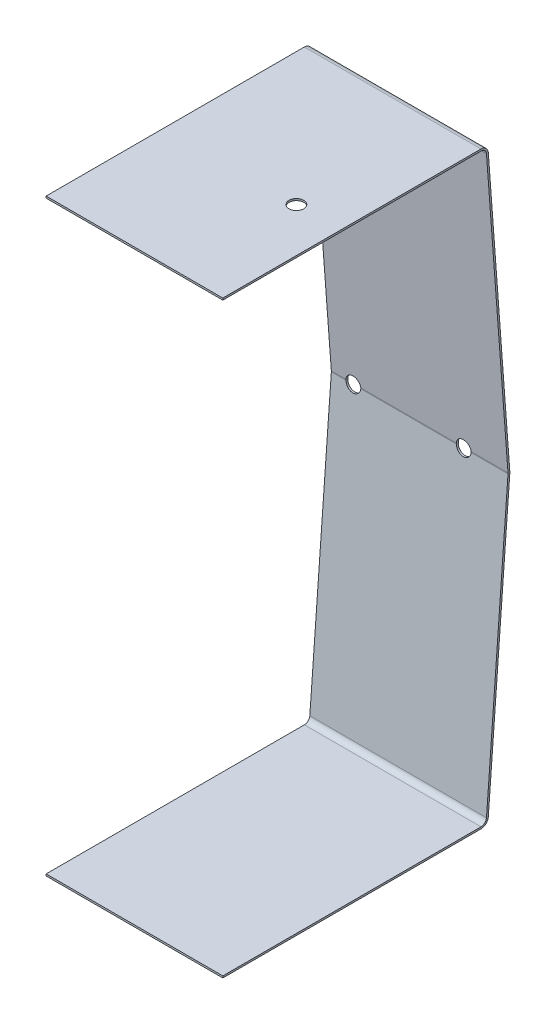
ISO-10303-21;
HEADER;
FILE_DESCRIPTION(('STEP AP214'),'2;1');
FILE_NAME('part.step','',(''),(''),'','','');
FILE_SCHEMA(('AUTOMOTIVE_DESIGN { 1 0 10303 214 1 1 1 1 }'));
ENDSEC;
DATA;
#1=APPLICATION_CONTEXT('core data for automotive mechanical design processes');
#2=APPLICATION_PROTOCOL_DEFINITION('international standard','automotive_design',2000,#1);
#3=PRODUCT_CONTEXT('',#1,'mechanical');
#4=PRODUCT('Part','Part','',(#3));
#5=PRODUCT_RELATED_PRODUCT_CATEGORY('part','',(#4));
#6=PRODUCT_DEFINITION_FORMATION('','',#4);
#7=PRODUCT_DEFINITION_CONTEXT('part definition',#1,'design');
#8=PRODUCT_DEFINITION('design','',#6,#7);
#9=PRODUCT_DEFINITION_SHAPE('','',#8);
#10=(LENGTH_UNIT() NAMED_UNIT(*) SI_UNIT(.MILLI.,.METRE.));
#11=(NAMED_UNIT(*) PLANE_ANGLE_UNIT() SI_UNIT($,.RADIAN.));
#12=(NAMED_UNIT(*) SI_UNIT($,.STERADIAN.) SOLID_ANGLE_UNIT());
#13=UNCERTAINTY_MEASURE_WITH_UNIT(LENGTH_MEASURE(1.E-05),#10,'distance_accuracy_value','');
#14=(GEOMETRIC_REPRESENTATION_CONTEXT(3) GLOBAL_UNCERTAINTY_ASSIGNED_CONTEXT((#13)) GLOBAL_UNIT_ASSIGNED_CONTEXT((#10,
#11,#12)) REPRESENTATION_CONTEXT('',''));
#15=CARTESIAN_POINT('',(0.,0.,0.));
#16=DIRECTION('',(0.,0.,1.));
#17=DIRECTION('',(1.,0.,0.));
#18=AXIS2_PLACEMENT_3D('',#15,#16,#17);
#19=CARTESIAN_POINT('',(-584.557062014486,0.,-241.282165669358));
#20=DIRECTION('',(1.,0.,0.));
#21=DIRECTION('',(0.,1.,0.));
#22=AXIS2_PLACEMENT_3D('',#19,#20,#21);
#23=CYLINDRICAL_SURFACE('',#22,6.35);
#24=CARTESIAN_POINT('',(38.0999999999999,0.,-241.282165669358));
#25=DIRECTION('',(0.707106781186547,0.,-0.707106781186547));
#26=DIRECTION('',(0.707106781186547,0.,0.707106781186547));
#27=AXIS2_PLACEMENT_3D('',#24,#25,#26);
#28=ELLIPSE('',#27,8.98025612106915,6.35);
#29=CARTESIAN_POINT('',(31.7677843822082,-0.474916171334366,-247.61438128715));
#30=VERTEX_POINT('',#29);
#31=CARTESIAN_POINT('',(31.7677843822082,0.474916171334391,-247.61438128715));
#32=VERTEX_POINT('',#31);
#33=EDGE_CURVE('E454',#30,#32,#28,.T.);
#34=ORIENTED_EDGE('',*,*,#33,.F.);
#35=DIRECTION('',(1.,0.,0.));
#36=VECTOR('',#35,1.);
#37=CARTESIAN_POINT('',(-584.557062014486,-0.474916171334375,-247.61438128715));
#38=LINE('',#37,#36);
#39=CARTESIAN_POINT('',(-50.8177843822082,-0.474916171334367,-247.61438128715));
#40=VERTEX_POINT('',#39);
#41=EDGE_CURVE('E335',#40,#30,#38,.T.);
#42=ORIENTED_EDGE('',*,*,#41,.F.);
#43=CARTESIAN_POINT('',(-57.1499999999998,0.,-241.282165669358));
#44=DIRECTION('',(0.707106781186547,0.,0.707106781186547));
#45=DIRECTION('',(0.707106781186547,0.,-0.707106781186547));
#46=AXIS2_PLACEMENT_3D('',#43,#44,#45);
#47=ELLIPSE('',#46,8.98025612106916,6.35);
#48=CARTESIAN_POINT('',(-50.8177843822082,0.47491617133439,-247.61438128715));
#49=VERTEX_POINT('',#48);
#50=EDGE_CURVE('E264',#49,#40,#47,.F.);
#51=ORIENTED_EDGE('',*,*,#50,.F.);
#52=DIRECTION('',(1.,0.,0.));
#53=VECTOR('',#52,1.);
#54=CARTESIAN_POINT('',(-584.557062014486,0.474916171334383,-247.61438128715));
#55=LINE('',#54,#53);
#56=EDGE_CURVE('E310',#32,#49,#55,.F.);
#57=ORIENTED_EDGE('',*,*,#56,.F.);
#58=EDGE_LOOP('',(#34,#42,#51,#57));
#59=FACE_BOUND('',#58,.T.);
#60=ADVANCED_FACE('F31',(#59),#23,.T.);
#61=CARTESIAN_POINT('',(-584.557062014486,0.,-241.282165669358));
#62=DIRECTION('',(1.,0.,0.));
#63=DIRECTION('',(0.,1.,0.));
#64=AXIS2_PLACEMENT_3D('',#61,#62,#63);
#65=CYLINDRICAL_SURFACE('',#64,4.7625);
#66=DIRECTION('',(1.,0.,0.));
#67=VECTOR('',#66,1.);
#68=CARTESIAN_POINT('',(-584.557062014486,-0.356187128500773,-246.031327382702));
#69=LINE('',#68,#67);
#70=CARTESIAN_POINT('',(-50.8099975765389,-0.356187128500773,-246.031327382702));
#71=VERTEX_POINT('',#70);
#72=CARTESIAN_POINT('',(31.7599975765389,-0.356187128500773,-246.031327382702));
#73=VERTEX_POINT('',#72);
#74=EDGE_CURVE('E446',#71,#73,#69,.T.);
#75=ORIENTED_EDGE('',*,*,#74,.T.);
#76=CARTESIAN_POINT('',(33.8998697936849,4.76250000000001,-241.282165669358));
#77=CARTESIAN_POINT('',(33.8998804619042,4.76250532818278,-241.170979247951));
#78=CARTESIAN_POINT('',(33.8954354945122,4.75859917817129,-241.059830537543));
#79=CARTESIAN_POINT('',(33.8779606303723,4.74310315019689,-240.838709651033));
#80=CARTESIAN_POINT('',(33.8649278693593,4.73151070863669,-240.728737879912));
#81=CARTESIAN_POINT('',(33.8309931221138,4.70091422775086,-240.510835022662));
#82=CARTESIAN_POINT('',(33.8100738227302,4.68189387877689,-240.402908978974));
#83=CARTESIAN_POINT('',(33.7614472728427,4.63686954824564,-240.190059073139));
#84=CARTESIAN_POINT('',(33.7337358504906,4.61086127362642,-240.085137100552));
#85=CARTESIAN_POINT('',(33.6431195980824,4.52389497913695,-239.778702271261));
#86=CARTESIAN_POINT('',(33.572146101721,4.4535029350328,-239.582190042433));
#87=CARTESIAN_POINT('',(33.4172962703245,4.29038797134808,-239.204576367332));
#88=CARTESIAN_POINT('',(33.3334214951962,4.19766775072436,-239.023473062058));
#89=CARTESIAN_POINT('',(33.1413766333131,3.97002711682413,-238.640228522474));
#90=CARTESIAN_POINT('',(33.0317973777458,3.83033545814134,-238.441625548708));
#91=CARTESIAN_POINT('',(32.8129379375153,3.52211266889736,-238.067366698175));
#92=CARTESIAN_POINT('',(32.7036584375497,3.35353906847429,-237.891745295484));
#93=CARTESIAN_POINT('',(32.5352030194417,3.06131721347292,-237.630945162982));
#94=CARTESIAN_POINT('',(32.473371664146,2.94643201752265,-237.537556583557));
#95=CARTESIAN_POINT('',(32.3542706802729,2.70683972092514,-237.360866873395));
#96=CARTESIAN_POINT('',(32.2970020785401,2.58213042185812,-237.277568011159));
#97=CARTESIAN_POINT('',(32.188753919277,2.32363022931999,-237.122258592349));
#98=CARTESIAN_POINT('',(32.1377625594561,2.18985713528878,-237.050226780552));
#99=CARTESIAN_POINT('',(32.0435301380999,1.91388198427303,-236.91846902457));
#100=CARTESIAN_POINT('',(32.0002849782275,1.77168443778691,-236.858736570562));
#101=CARTESIAN_POINT('',(31.9077116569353,1.42208167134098,-236.731788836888));
#102=CARTESIAN_POINT('',(31.8627349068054,1.21111732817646,-236.670947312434));
#103=CARTESIAN_POINT('',(31.7942578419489,0.779603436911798,-236.578736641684));
#104=CARTESIAN_POINT('',(31.7707388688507,0.559062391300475,-236.547341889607));
#105=CARTESIAN_POINT('',(31.7471023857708,0.11387868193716,-236.515790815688));
#106=CARTESIAN_POINT('',(31.7470456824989,-0.11077313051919,-236.515715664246));
#107=CARTESIAN_POINT('',(31.7705029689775,-0.556630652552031,-236.547026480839));
#108=CARTESIAN_POINT('',(31.7940224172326,-0.777835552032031,-236.578419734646));
#109=CARTESIAN_POINT('',(31.8613990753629,-1.202972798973,-236.66914838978));
#110=CARTESIAN_POINT('',(31.9045321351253,-1.40723724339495,-236.727489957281));
#111=CARTESIAN_POINT('',(32.0077372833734,-1.80238534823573,-236.868901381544));
#112=CARTESIAN_POINT('',(32.0678130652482,-1.99326607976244,-236.951976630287));
#113=CARTESIAN_POINT('',(32.2084380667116,-2.37876501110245,-237.149998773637));
#114=CARTESIAN_POINT('',(32.2904997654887,-2.57155002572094,-237.267422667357));
#115=CARTESIAN_POINT('',(32.4656177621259,-2.9354958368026,-237.525289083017));
#116=CARTESIAN_POINT('',(32.5586834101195,-3.10663798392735,-237.665751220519));
#117=CARTESIAN_POINT('',(32.7693950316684,-3.45785877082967,-237.99677710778));
#118=CARTESIAN_POINT('',(32.8882749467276,-3.63307252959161,-238.19176114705));
#119=CARTESIAN_POINT('',(33.065001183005,-3.87054234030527,-238.504139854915));
#120=CARTESIAN_POINT('',(33.1236829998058,-3.94551541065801,-238.611661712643));
#121=CARTESIAN_POINT('',(33.239018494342,-4.086766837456,-238.833288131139));
#122=CARTESIAN_POINT('',(33.2956726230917,-4.15304713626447,-238.947391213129));
#123=CARTESIAN_POINT('',(33.4384686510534,-4.31394545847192,-239.253210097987));
#124=CARTESIAN_POINT('',(33.5217223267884,-4.40145884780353,-239.450130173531));
#125=CARTESIAN_POINT('',(33.6697123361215,-4.55039851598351,-239.859992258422));
#126=CARTESIAN_POINT('',(33.734490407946,-4.61188374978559,-240.072896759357));
#127=CARTESIAN_POINT('',(33.8251776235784,-4.69589922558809,-240.468368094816));
#128=CARTESIAN_POINT('',(33.8562458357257,-4.72373494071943,-240.64858452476));
#129=CARTESIAN_POINT('',(33.8951703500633,-4.75842891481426,-241.013419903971));
#130=CARTESIAN_POINT('',(33.9030563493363,-4.76531401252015,-241.198032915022));
#131=CARTESIAN_POINT('',(33.89430355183,-4.75758677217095,-241.566262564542));
#132=CARTESIAN_POINT('',(33.8776557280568,-4.74296652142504,-241.749878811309));
#133=CARTESIAN_POINT('',(33.8226024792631,-4.69336694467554,-242.111077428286));
#134=CARTESIAN_POINT('',(33.7841599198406,-4.65835286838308,-242.288648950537));
#135=CARTESIAN_POINT('',(33.673162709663,-4.55338460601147,-242.699315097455));
#136=CARTESIAN_POINT('',(33.5932257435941,-4.47525785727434,-242.928314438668));
#137=CARTESIAN_POINT('',(33.460089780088,-4.33565615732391,-243.256427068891));
#138=CARTESIAN_POINT('',(33.4134377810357,-4.28530809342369,-243.363360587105));
#139=CARTESIAN_POINT('',(33.3170618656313,-4.17746704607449,-243.572133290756));
#140=CARTESIAN_POINT('',(33.2673382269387,-4.11997470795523,-243.67397293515));
#141=CARTESIAN_POINT('',(33.111873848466,-3.9329276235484,-243.97877815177));
#142=CARTESIAN_POINT('',(33.0031106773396,-3.79207620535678,-244.173381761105));
#143=CARTESIAN_POINT('',(32.7866869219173,-3.48237814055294,-244.539765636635));
#144=CARTESIAN_POINT('',(32.6790269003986,-3.31351789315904,-244.711534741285));
#145=CARTESIAN_POINT('',(32.5127053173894,-3.02009775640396,-244.967561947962));
#146=CARTESIAN_POINT('',(32.451320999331,-2.90397323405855,-245.059807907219));
#147=CARTESIAN_POINT('',(32.3333119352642,-2.66194041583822,-245.234091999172));
#148=CARTESIAN_POINT('',(32.2766882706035,-2.53602990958,-245.316127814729));
#149=CARTESIAN_POINT('',(32.1699141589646,-2.27517011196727,-245.468786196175));
#150=CARTESIAN_POINT('',(32.1197528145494,-2.14023663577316,-245.539428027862));
#151=CARTESIAN_POINT('',(32.027376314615,-1.8620506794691,-245.668243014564));
#152=CARTESIAN_POINT('',(31.9851568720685,-1.71880274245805,-245.726422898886));
#153=CARTESIAN_POINT('',(31.8954836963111,-1.36774808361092,-245.849148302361));
#154=CARTESIAN_POINT('',(31.8523919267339,-1.15652041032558,-245.90735295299));
#155=CARTESIAN_POINT('',(31.7877607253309,-0.725030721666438,-245.994290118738));
#156=CARTESIAN_POINT('',(31.7662020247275,-0.504776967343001,-246.023048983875));
#157=CARTESIAN_POINT('',(31.7463978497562,-0.0608007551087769,-246.049476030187));
#158=CARTESIAN_POINT('',(31.7482071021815,0.162928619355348,-246.047071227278));
#159=CARTESIAN_POINT('',(31.7751195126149,0.606455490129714,-246.011135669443));
#160=CARTESIAN_POINT('',(31.8002288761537,0.826251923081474,-245.977596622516));
#161=CARTESIAN_POINT('',(31.870542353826,1.24943174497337,-245.882819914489));
#162=CARTESIAN_POINT('',(31.9151419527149,1.4531063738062,-245.822414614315));
#163=CARTESIAN_POINT('',(32.0210582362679,1.84677456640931,-245.677039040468));
#164=CARTESIAN_POINT('',(32.0823784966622,2.03676519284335,-245.592063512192));
#165=CARTESIAN_POINT('',(32.2256912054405,2.42109026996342,-245.389731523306));
#166=CARTESIAN_POINT('',(32.309238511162,2.6134787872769,-245.269797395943));
#167=CARTESIAN_POINT('',(32.487054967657,2.97628666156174,-245.006871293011));
#168=CARTESIAN_POINT('',(32.5813339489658,3.14668556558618,-244.863858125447));
#169=CARTESIAN_POINT('',(32.7943966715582,3.49609221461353,-244.52696915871));
#170=CARTESIAN_POINT('',(32.9143385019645,3.6701345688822,-244.328628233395));
#171=CARTESIAN_POINT('',(33.0919946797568,3.90539577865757,-244.011021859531));
#172=CARTESIAN_POINT('',(33.1508738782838,3.97955456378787,-243.901728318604));
#173=CARTESIAN_POINT('',(33.2663174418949,4.11900421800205,-243.676480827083));
#174=CARTESIAN_POINT('',(33.3228824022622,4.18429737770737,-243.560528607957));
#175=CARTESIAN_POINT('',(33.4629128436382,4.34007035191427,-243.254283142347));
#176=CARTESIAN_POINT('',(33.5434407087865,4.42383314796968,-243.059123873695));
#177=CARTESIAN_POINT('',(33.6857177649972,4.56582768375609,-242.653480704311));
#178=CARTESIAN_POINT('',(33.747516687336,4.62412722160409,-242.443039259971));
#179=CARTESIAN_POINT('',(33.8285994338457,4.69890760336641,-242.073423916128));
#180=CARTESIAN_POINT('',(33.8550349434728,4.72263653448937,-241.917296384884));
#181=CARTESIAN_POINT('',(33.8906568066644,4.75442376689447,-241.6014736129));
#182=CARTESIAN_POINT('',(33.8998544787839,4.76249235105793,-241.441780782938));
#183=CARTESIAN_POINT('',(33.8998697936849,4.76250000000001,-241.282165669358));
#184=B_SPLINE_CURVE_WITH_KNOTS('',3,(#76,#77,#78,#79,#80,#81,#82,#83,#84,#85,#86,#87,#88,#89,
#90,#91,#92,#93,#94,#95,#96,#97,#98,#99,#100,#101,#102,#103,#104,#105,#106,#107,#108,#109,#110,
#111,#112,#113,#114,#115,#116,#117,#118,#119,#120,#121,#122,#123,#124,#125,#126,#127,#128,#129,
#130,#131,#132,#133,#134,#135,#136,#137,#138,#139,#140,#141,#142,#143,#144,#145,#146,#147,#148,
#149,#150,#151,#152,#153,#154,#155,#156,#157,#158,#159,#160,#161,#162,#163,#164,#165,#166,#167,
#168,#169,#170,#171,#172,#173,#174,#175,#176,#177,#178,#179,#180,#181,#182,#183),.UNSPECIFIED.,
.T.,.F.,(4,2,2,2,2,2,2,2,2,2,2,2,2,2,2,2,2,2,2,2,2,2,2,2,2,2,2,2,2,2,2,2,2,2,2,2,2,2,2,2,2,2,2,
2,2,2,2,2,2,2,2,2,2,4),(0.,0.333341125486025,0.66679348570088,1.00098217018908,1.3353766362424,
1.99404836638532,2.65264051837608,3.44917214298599,4.24688525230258,4.72763995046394,
5.20850253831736,5.6884467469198,6.16813627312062,6.8374204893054,7.5061221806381,
8.17655692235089,8.84714692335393,9.49476946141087,10.1425332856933,10.8604350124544,
11.5789511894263,12.4388123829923,12.869318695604,13.2997286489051,13.9904429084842,
14.6795841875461,15.2321408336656,15.7839893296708,16.3360409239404,16.8890359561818,
17.6490150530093,18.0299816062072,18.4109137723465,19.1993471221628,19.9881644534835,
20.4690827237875,20.9501099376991,21.4303150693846,21.9102602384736,22.5770676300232,
23.2432777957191,23.9110484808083,24.5789970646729,25.2275549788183,25.8762516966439,
26.5984323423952,27.3212799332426,28.1871238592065,28.6205951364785,29.0539542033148,
29.7330883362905,30.4104030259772,30.8892497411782,31.3677819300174),.UNSPECIFIED.);
#185=CARTESIAN_POINT('',(31.7599975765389,0.356187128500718,-246.031327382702));
#186=VERTEX_POINT('',#185);
#187=EDGE_CURVE('E11',#73,#186,#184,.T.);
#188=ORIENTED_EDGE('',*,*,#187,.T.);
#189=DIRECTION('',(1.,0.,0.));
#190=VECTOR('',#189,1.);
#191=CARTESIAN_POINT('',(-584.557062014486,0.356187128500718,-246.031327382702));
#192=LINE('',#191,#190);
#193=CARTESIAN_POINT('',(-50.8099975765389,0.356187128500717,-246.031327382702));
#194=VERTEX_POINT('',#193);
#195=EDGE_CURVE('E209',#186,#194,#192,.F.);
#196=ORIENTED_EDGE('',*,*,#195,.T.);
#197=CARTESIAN_POINT('',(-52.9498697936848,4.76250000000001,-241.282165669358));
#198=CARTESIAN_POINT('',(-52.9498804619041,4.76250532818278,-241.393352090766));
#199=CARTESIAN_POINT('',(-52.9454354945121,4.75859917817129,-241.504500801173));
#200=CARTESIAN_POINT('',(-52.9279606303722,4.74310315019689,-241.725621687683));
#201=CARTESIAN_POINT('',(-52.9149278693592,4.73151070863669,-241.835593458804));
#202=CARTESIAN_POINT('',(-52.8809931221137,4.70091422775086,-242.053496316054));
#203=CARTESIAN_POINT('',(-52.8600738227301,4.6818938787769,-242.161422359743));
#204=CARTESIAN_POINT('',(-52.8114472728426,4.63686954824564,-242.374272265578));
#205=CARTESIAN_POINT('',(-52.7837358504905,4.61086127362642,-242.479194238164));
#206=CARTESIAN_POINT('',(-52.6931195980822,4.52389497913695,-242.785629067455));
#207=CARTESIAN_POINT('',(-52.6221461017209,4.4535029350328,-242.982141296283));
#208=CARTESIAN_POINT('',(-52.4672962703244,4.29038797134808,-243.359754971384));
#209=CARTESIAN_POINT('',(-52.383421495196,4.19766775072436,-243.540858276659));
#210=CARTESIAN_POINT('',(-52.191376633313,3.97002711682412,-243.924102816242));
#211=CARTESIAN_POINT('',(-52.0817973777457,3.83033545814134,-244.122705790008));
#212=CARTESIAN_POINT('',(-51.8629379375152,3.52211266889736,-244.496964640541));
#213=CARTESIAN_POINT('',(-51.7536584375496,3.35353906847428,-244.672586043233));
#214=CARTESIAN_POINT('',(-51.5852030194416,3.06131721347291,-244.933386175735));
#215=CARTESIAN_POINT('',(-51.5233716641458,2.94643201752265,-245.026774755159));
#216=CARTESIAN_POINT('',(-51.4042706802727,2.70683972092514,-245.203464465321));
#217=CARTESIAN_POINT('',(-51.3470020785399,2.58213042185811,-245.286763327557));
#218=CARTESIAN_POINT('',(-51.2387539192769,2.32363022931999,-245.442072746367));
#219=CARTESIAN_POINT('',(-51.187762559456,2.18985713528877,-245.514104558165));
#220=CARTESIAN_POINT('',(-51.0935301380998,1.91388198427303,-245.645862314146));
#221=CARTESIAN_POINT('',(-51.0502849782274,1.77168443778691,-245.705594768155));
#222=CARTESIAN_POINT('',(-50.9577116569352,1.42208167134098,-245.832542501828));
#223=CARTESIAN_POINT('',(-50.9127349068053,1.21111732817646,-245.893384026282));
#224=CARTESIAN_POINT('',(-50.8442578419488,0.779603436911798,-245.985594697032));
#225=CARTESIAN_POINT('',(-50.8207388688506,0.559062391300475,-246.01698944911));
#226=CARTESIAN_POINT('',(-50.7971023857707,0.11387868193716,-246.048540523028));
#227=CARTESIAN_POINT('',(-50.7970456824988,-0.11077313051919,-246.048615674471));
#228=CARTESIAN_POINT('',(-50.8205029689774,-0.556630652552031,-246.017304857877));
#229=CARTESIAN_POINT('',(-50.8440224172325,-0.77783555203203,-245.98591160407));
#230=CARTESIAN_POINT('',(-50.9113990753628,-1.202972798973,-245.895182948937));
#231=CARTESIAN_POINT('',(-50.9545321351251,-1.40723724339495,-245.836841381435));
#232=CARTESIAN_POINT('',(-51.0577372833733,-1.80238534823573,-245.695429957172));
#233=CARTESIAN_POINT('',(-51.1178130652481,-1.99326607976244,-245.61235470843));
#234=CARTESIAN_POINT('',(-51.2584380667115,-2.37876501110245,-245.414332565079));
#235=CARTESIAN_POINT('',(-51.3404997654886,-2.57155002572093,-245.296908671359));
#236=CARTESIAN_POINT('',(-51.5156177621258,-2.93549583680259,-245.0390422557));
#237=CARTESIAN_POINT('',(-51.6086834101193,-3.10663798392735,-244.898580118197));
#238=CARTESIAN_POINT('',(-51.8193950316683,-3.45785877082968,-244.567554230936));
#239=CARTESIAN_POINT('',(-51.9382749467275,-3.63307252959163,-244.372570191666));
#240=CARTESIAN_POINT('',(-52.1150011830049,-3.87054234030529,-244.060191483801));
#241=CARTESIAN_POINT('',(-52.1736829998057,-3.94551541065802,-243.952669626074));
#242=CARTESIAN_POINT('',(-52.2890184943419,-4.086766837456,-243.731043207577));
#243=CARTESIAN_POINT('',(-52.3456726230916,-4.15304713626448,-243.616940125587));
#244=CARTESIAN_POINT('',(-52.4884686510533,-4.31394545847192,-243.311121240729));
#245=CARTESIAN_POINT('',(-52.5717223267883,-4.40145884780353,-243.114201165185));
#246=CARTESIAN_POINT('',(-52.7197123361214,-4.55039851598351,-242.704339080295));
#247=CARTESIAN_POINT('',(-52.7844904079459,-4.61188374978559,-242.491434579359));
#248=CARTESIAN_POINT('',(-52.8751776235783,-4.69589922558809,-242.0959632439));
#249=CARTESIAN_POINT('',(-52.9062458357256,-4.72373494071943,-241.915746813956));
#250=CARTESIAN_POINT('',(-52.9451703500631,-4.75842891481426,-241.550911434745));
#251=CARTESIAN_POINT('',(-52.9530563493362,-4.76531401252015,-241.366298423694));
#252=CARTESIAN_POINT('',(-52.9443035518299,-4.75758677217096,-240.998068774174));
#253=CARTESIAN_POINT('',(-52.9276557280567,-4.74296652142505,-240.814452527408));
#254=CARTESIAN_POINT('',(-52.872602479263,-4.69336694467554,-240.45325391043));
#255=CARTESIAN_POINT('',(-52.8341599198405,-4.65835286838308,-240.275682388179));
#256=CARTESIAN_POINT('',(-52.7231627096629,-4.55338460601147,-239.865016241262));
#257=CARTESIAN_POINT('',(-52.643225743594,-4.47525785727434,-239.636016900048));
#258=CARTESIAN_POINT('',(-52.5100897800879,-4.33565615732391,-239.307904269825));
#259=CARTESIAN_POINT('',(-52.4634377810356,-4.28530809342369,-239.200970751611));
#260=CARTESIAN_POINT('',(-52.3670618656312,-4.17746704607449,-238.99219804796));
#261=CARTESIAN_POINT('',(-52.3173382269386,-4.11997470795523,-238.890358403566));
#262=CARTESIAN_POINT('',(-52.1618738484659,-3.9329276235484,-238.585553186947));
#263=CARTESIAN_POINT('',(-52.0531106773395,-3.79207620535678,-238.390949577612));
#264=CARTESIAN_POINT('',(-51.8366869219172,-3.48237814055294,-238.024565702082));
#265=CARTESIAN_POINT('',(-51.7290269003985,-3.31351789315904,-237.852796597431));
#266=CARTESIAN_POINT('',(-51.5627053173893,-3.02009775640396,-237.596769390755));
#267=CARTESIAN_POINT('',(-51.5013209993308,-2.90397323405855,-237.504523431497));
#268=CARTESIAN_POINT('',(-51.383311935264,-2.66194041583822,-237.330239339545));
#269=CARTESIAN_POINT('',(-51.3266882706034,-2.53602990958,-237.248203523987));
#270=CARTESIAN_POINT('',(-51.2199141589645,-2.27517011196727,-237.095545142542));
#271=CARTESIAN_POINT('',(-51.1697528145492,-2.14023663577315,-237.024903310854));
#272=CARTESIAN_POINT('',(-51.0773763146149,-1.86205067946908,-236.896088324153));
#273=CARTESIAN_POINT('',(-51.0351568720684,-1.71880274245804,-236.837908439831));
#274=CARTESIAN_POINT('',(-50.9454836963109,-1.36774808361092,-236.715183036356));
#275=CARTESIAN_POINT('',(-50.9023919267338,-1.15652041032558,-236.656978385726));
#276=CARTESIAN_POINT('',(-50.8377607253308,-0.725030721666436,-236.570041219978));
#277=CARTESIAN_POINT('',(-50.8162020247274,-0.504776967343,-236.541282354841));
#278=CARTESIAN_POINT('',(-50.7963978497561,-0.0608007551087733,-236.514855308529));
#279=CARTESIAN_POINT('',(-50.7982071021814,0.162928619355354,-236.517260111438));
#280=CARTESIAN_POINT('',(-50.8251195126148,0.60645549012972,-236.553195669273));
#281=CARTESIAN_POINT('',(-50.8502288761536,0.826251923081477,-236.586734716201));
#282=CARTESIAN_POINT('',(-50.9205423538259,1.24943174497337,-236.681511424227));
#283=CARTESIAN_POINT('',(-50.9651419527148,1.45310637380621,-236.741916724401));
#284=CARTESIAN_POINT('',(-51.0710582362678,1.84677456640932,-236.887292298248));
#285=CARTESIAN_POINT('',(-51.1323784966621,2.03676519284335,-236.972267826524));
#286=CARTESIAN_POINT('',(-51.2756912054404,2.42109026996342,-237.174599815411));
#287=CARTESIAN_POINT('',(-51.3592385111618,2.6134787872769,-237.294533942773));
#288=CARTESIAN_POINT('',(-51.5370549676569,2.97628666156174,-237.557460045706));
#289=CARTESIAN_POINT('',(-51.6313339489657,3.14668556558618,-237.700473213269));
#290=CARTESIAN_POINT('',(-51.8443966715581,3.49609221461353,-238.037362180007));
#291=CARTESIAN_POINT('',(-51.9643385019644,3.6701345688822,-238.235703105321));
#292=CARTESIAN_POINT('',(-52.1419946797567,3.90539577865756,-238.553309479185));
#293=CARTESIAN_POINT('',(-52.2008738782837,3.97955456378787,-238.662603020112));
#294=CARTESIAN_POINT('',(-52.3163174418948,4.11900421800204,-238.887850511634));
#295=CARTESIAN_POINT('',(-52.3728824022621,4.18429737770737,-239.003802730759));
#296=CARTESIAN_POINT('',(-52.5129128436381,4.34007035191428,-239.310048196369));
#297=CARTESIAN_POINT('',(-52.5934407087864,4.42383314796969,-239.505207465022));
#298=CARTESIAN_POINT('',(-52.7357177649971,4.56582768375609,-239.910850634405));
#299=CARTESIAN_POINT('',(-52.7975166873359,4.62412722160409,-240.121292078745));
#300=CARTESIAN_POINT('',(-52.8785994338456,4.69890760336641,-240.490907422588));
#301=CARTESIAN_POINT('',(-52.9050349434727,4.72263653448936,-240.647034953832));
#302=CARTESIAN_POINT('',(-52.9406568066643,4.75442376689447,-240.962857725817));
#303=CARTESIAN_POINT('',(-52.9498544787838,4.76249235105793,-241.122550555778));
#304=CARTESIAN_POINT('',(-52.9498697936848,4.76250000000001,-241.282165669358));
#305=B_SPLINE_CURVE_WITH_KNOTS('',3,(#197,#198,#199,#200,#201,#202,#203,#204,#205,#206,#207,
#208,#209,#210,#211,#212,#213,#214,#215,#216,#217,#218,#219,#220,#221,#222,#223,#224,#225,#226,
#227,#228,#229,#230,#231,#232,#233,#234,#235,#236,#237,#238,#239,#240,#241,#242,#243,#244,#245,
#246,#247,#248,#249,#250,#251,#252,#253,#254,#255,#256,#257,#258,#259,#260,#261,#262,#263,#264,
#265,#266,#267,#268,#269,#270,#271,#272,#273,#274,#275,#276,#277,#278,#279,#280,#281,#282,#283,
#284,#285,#286,#287,#288,#289,#290,#291,#292,#293,#294,#295,#296,#297,#298,#299,#300,#301,#302,
#303,#304),.UNSPECIFIED.,.T.,.F.,(4,2,2,2,2,2,2,2,2,2,2,2,2,2,2,2,2,2,2,2,2,2,2,2,2,2,2,2,2,2,2,
2,2,2,2,2,2,2,2,2,2,2,2,2,2,2,2,2,2,2,2,2,2,4),(0.,0.333341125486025,0.666793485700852,
1.00098217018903,1.3353766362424,1.99404836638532,2.65264051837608,3.44917214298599,
4.24688525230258,4.72763995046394,5.20850253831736,5.6884467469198,6.16813627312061,
6.8374204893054,7.5061221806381,8.17655692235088,8.84714692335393,9.49476946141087,
10.1425332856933,10.8604350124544,11.5789511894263,12.4388123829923,12.869318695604,
13.2997286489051,13.9904429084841,14.6795841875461,15.2321408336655,15.7839893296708,
16.3360409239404,16.8890359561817,17.6490150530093,18.0299816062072,18.4109137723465,
19.1993471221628,19.9881644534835,20.4690827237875,20.9501099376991,21.4303150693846,
21.9102602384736,22.5770676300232,23.2432777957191,23.9110484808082,24.5789970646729,
25.2275549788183,25.8762516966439,26.5984323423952,27.3212799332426,28.1871238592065,
28.6205951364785,29.0539542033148,29.7330883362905,30.4104030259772,30.8892497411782,
31.3677819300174),.UNSPECIFIED.);
#306=EDGE_CURVE('E337',#194,#71,#305,.T.);
#307=ORIENTED_EDGE('',*,*,#306,.T.);
#308=EDGE_LOOP('',(#75,#188,#196,#307));
#309=FACE_BOUND('',#308,.T.);
#310=ADVANCED_FACE('F375',(#309),#65,.F.);
#311=CARTESIAN_POINT('',(-57.1499999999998,0.,-241.282165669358));
#312=DIRECTION('',(0.707106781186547,0.,-0.707106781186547));
#313=DIRECTION('',(0.707106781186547,0.,0.707106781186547));
#314=AXIS2_PLACEMENT_3D('',#311,#312,#313);
#315=ELLIPSE('',#314,8.98025612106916,6.35);
#316=CARTESIAN_POINT('',(-63.4822156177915,-0.474916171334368,-247.61438128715));
#317=VERTEX_POINT('',#316);
#318=CARTESIAN_POINT('',(-63.4822156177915,0.47491617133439,-247.61438128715));
#319=VERTEX_POINT('',#318);
#320=EDGE_CURVE('E463',#317,#319,#315,.T.);
#321=ORIENTED_EDGE('',*,*,#320,.F.);
#322=CARTESIAN_POINT('',(-76.1999999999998,-0.474916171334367,-247.61438128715));
#323=VERTEX_POINT('',#322);
#324=EDGE_CURVE('E331',#323,#317,#38,.T.);
#325=ORIENTED_EDGE('',*,*,#324,.F.);
#326=CARTESIAN_POINT('',(-76.1999999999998,0.,-241.282165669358));
#327=DIRECTION('',(-1.,0.,0.));
#328=DIRECTION('',(0.,-1.,0.));
#329=AXIS2_PLACEMENT_3D('',#326,#327,#328);
#330=CIRCLE('',#329,6.35);
#331=CARTESIAN_POINT('',(-76.1999999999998,0.474916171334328,-247.61438128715));
#332=VERTEX_POINT('',#331);
#333=EDGE_CURVE('E323',#332,#323,#330,.T.);
#334=ORIENTED_EDGE('',*,*,#333,.F.);
#335=EDGE_CURVE('E298',#319,#332,#55,.F.);
#336=ORIENTED_EDGE('',*,*,#335,.F.);
#337=EDGE_LOOP('',(#321,#325,#334,#336));
#338=FACE_BOUND('',#337,.T.);
#339=ADVANCED_FACE('F379',(#338),#23,.T.);
#340=CARTESIAN_POINT('',(-76.1999999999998,-0.356187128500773,-246.031327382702));
#341=VERTEX_POINT('',#340);
#342=CARTESIAN_POINT('',(-63.4900024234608,-0.356187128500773,-246.031327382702));
#343=VERTEX_POINT('',#342);
#344=EDGE_CURVE('E443',#341,#343,#69,.T.);
#345=ORIENTED_EDGE('',*,*,#344,.T.);
#346=CARTESIAN_POINT('',(-61.3501302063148,4.76250000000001,-241.282165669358));
#347=CARTESIAN_POINT('',(-61.3501195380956,4.76250532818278,-241.170979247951));
#348=CARTESIAN_POINT('',(-61.3545645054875,4.75859917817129,-241.059830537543));
#349=CARTESIAN_POINT('',(-61.3720393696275,4.74310315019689,-240.838709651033));
#350=CARTESIAN_POINT('',(-61.3850721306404,4.73151070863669,-240.728737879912));
#351=CARTESIAN_POINT('',(-61.419006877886,4.70091422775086,-240.510835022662));
#352=CARTESIAN_POINT('',(-61.4399261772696,4.68189387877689,-240.402908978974));
#353=CARTESIAN_POINT('',(-61.4885527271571,4.63686954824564,-240.190059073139));
#354=CARTESIAN_POINT('',(-61.5162641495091,4.61086127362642,-240.085137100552));
#355=CARTESIAN_POINT('',(-61.6068804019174,4.52389497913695,-239.778702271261));
#356=CARTESIAN_POINT('',(-61.6778538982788,4.4535029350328,-239.582190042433));
#357=CARTESIAN_POINT('',(-61.8327037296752,4.29038797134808,-239.204576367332));
#358=CARTESIAN_POINT('',(-61.9165785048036,4.19766775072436,-239.023473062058));
#359=CARTESIAN_POINT('',(-62.1086233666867,3.97002711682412,-238.640228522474));
#360=CARTESIAN_POINT('',(-62.218202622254,3.83033545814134,-238.441625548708));
#361=CARTESIAN_POINT('',(-62.4370620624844,3.52211266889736,-238.067366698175));
#362=CARTESIAN_POINT('',(-62.5463415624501,3.35353906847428,-237.891745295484));
#363=CARTESIAN_POINT('',(-62.7147969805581,3.06131721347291,-237.630945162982));
#364=CARTESIAN_POINT('',(-62.7766283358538,2.94643201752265,-237.537556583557));
#365=CARTESIAN_POINT('',(-62.8957293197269,2.70683972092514,-237.360866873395));
#366=CARTESIAN_POINT('',(-62.9529979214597,2.58213042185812,-237.277568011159));
#367=CARTESIAN_POINT('',(-63.0612460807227,2.32363022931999,-237.122258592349));
#368=CARTESIAN_POINT('',(-63.1122374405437,2.18985713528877,-237.050226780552));
#369=CARTESIAN_POINT('',(-63.2064698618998,1.91388198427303,-236.91846902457));
#370=CARTESIAN_POINT('',(-63.2497150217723,1.77168443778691,-236.858736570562));
#371=CARTESIAN_POINT('',(-63.3422883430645,1.42208167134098,-236.731788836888));
#372=CARTESIAN_POINT('',(-63.3872650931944,1.21111732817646,-236.670947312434));
#373=CARTESIAN_POINT('',(-63.4557421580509,0.7796034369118,-236.578736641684));
#374=CARTESIAN_POINT('',(-63.4792611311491,0.559062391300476,-236.547341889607));
#375=CARTESIAN_POINT('',(-63.5028976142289,0.113878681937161,-236.515790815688));
#376=CARTESIAN_POINT('',(-63.5029543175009,-0.110773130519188,-236.515715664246));
#377=CARTESIAN_POINT('',(-63.4794970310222,-0.55663065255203,-236.547026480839));
#378=CARTESIAN_POINT('',(-63.4559775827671,-0.777835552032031,-236.578419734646));
#379=CARTESIAN_POINT('',(-63.3886009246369,-1.202972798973,-236.66914838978));
#380=CARTESIAN_POINT('',(-63.3454678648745,-1.40723724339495,-236.727489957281));
#381=CARTESIAN_POINT('',(-63.2422627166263,-1.80238534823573,-236.868901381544));
#382=CARTESIAN_POINT('',(-63.1821869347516,-1.99326607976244,-236.951976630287));
#383=CARTESIAN_POINT('',(-63.0415619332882,-2.37876501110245,-237.149998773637));
#384=CARTESIAN_POINT('',(-62.9595002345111,-2.57155002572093,-237.267422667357));
#385=CARTESIAN_POINT('',(-62.7843822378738,-2.93549583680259,-237.525289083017));
#386=CARTESIAN_POINT('',(-62.6913165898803,-3.10663798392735,-237.665751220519));
#387=CARTESIAN_POINT('',(-62.4806049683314,-3.45785877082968,-237.99677710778));
#388=CARTESIAN_POINT('',(-62.3617250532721,-3.63307252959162,-238.19176114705));
#389=CARTESIAN_POINT('',(-62.1849988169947,-3.87054234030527,-238.504139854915));
#390=CARTESIAN_POINT('',(-62.126317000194,-3.94551541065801,-238.611661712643));
#391=CARTESIAN_POINT('',(-62.0109815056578,-4.086766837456,-238.833288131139));
#392=CARTESIAN_POINT('',(-61.9543273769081,-4.15304713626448,-238.947391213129));
#393=CARTESIAN_POINT('',(-61.8115313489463,-4.31394545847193,-239.253210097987));
#394=CARTESIAN_POINT('',(-61.7282776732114,-4.40145884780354,-239.450130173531));
#395=CARTESIAN_POINT('',(-61.5802876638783,-4.55039851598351,-239.859992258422));
#396=CARTESIAN_POINT('',(-61.5155095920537,-4.6118837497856,-240.072896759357));
#397=CARTESIAN_POINT('',(-61.4248223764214,-4.69589922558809,-240.468368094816));
#398=CARTESIAN_POINT('',(-61.393754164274,-4.72373494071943,-240.64858452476));
#399=CARTESIAN_POINT('',(-61.3548296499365,-4.75842891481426,-241.013419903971));
#400=CARTESIAN_POINT('',(-61.3469436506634,-4.76531401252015,-241.198032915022));
#401=CARTESIAN_POINT('',(-61.3556964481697,-4.75758677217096,-241.566262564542));
#402=CARTESIAN_POINT('',(-61.3723442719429,-4.74296652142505,-241.749878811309));
#403=CARTESIAN_POINT('',(-61.4273975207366,-4.69336694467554,-242.111077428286));
#404=CARTESIAN_POINT('',(-61.4658400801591,-4.65835286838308,-242.288648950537));
#405=CARTESIAN_POINT('',(-61.5768372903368,-4.55338460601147,-242.699315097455));
#406=CARTESIAN_POINT('',(-61.6567742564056,-4.47525785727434,-242.928314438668));
#407=CARTESIAN_POINT('',(-61.7899102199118,-4.33565615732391,-243.256427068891));
#408=CARTESIAN_POINT('',(-61.8365622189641,-4.28530809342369,-243.363360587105));
#409=CARTESIAN_POINT('',(-61.9329381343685,-4.17746704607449,-243.572133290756));
#410=CARTESIAN_POINT('',(-61.9826617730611,-4.11997470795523,-243.67397293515));
#411=CARTESIAN_POINT('',(-62.1381261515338,-3.9329276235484,-243.97877815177));
#412=CARTESIAN_POINT('',(-62.2468893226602,-3.79207620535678,-244.173381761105));
#413=CARTESIAN_POINT('',(-62.4633130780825,-3.48237814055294,-244.539765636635));
#414=CARTESIAN_POINT('',(-62.5709730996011,-3.31351789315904,-244.711534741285));
#415=CARTESIAN_POINT('',(-62.7372946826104,-3.02009775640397,-244.967561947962));
#416=CARTESIAN_POINT('',(-62.7986790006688,-2.90397323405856,-245.059807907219));
#417=CARTESIAN_POINT('',(-62.9166880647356,-2.66194041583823,-245.234091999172));
#418=CARTESIAN_POINT('',(-62.9733117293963,-2.53602990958,-245.316127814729));
#419=CARTESIAN_POINT('',(-63.0800858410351,-2.27517011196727,-245.468786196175));
#420=CARTESIAN_POINT('',(-63.1302471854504,-2.14023663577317,-245.539428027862));
#421=CARTESIAN_POINT('',(-63.2226236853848,-1.8620506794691,-245.668243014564));
#422=CARTESIAN_POINT('',(-63.2648431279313,-1.71880274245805,-245.726422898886));
#423=CARTESIAN_POINT('',(-63.3545163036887,-1.36774808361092,-245.849148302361));
#424=CARTESIAN_POINT('',(-63.3976080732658,-1.15652041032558,-245.90735295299));
#425=CARTESIAN_POINT('',(-63.4622392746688,-0.725030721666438,-245.994290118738));
#426=CARTESIAN_POINT('',(-63.4837979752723,-0.504776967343,-246.023048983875));
#427=CARTESIAN_POINT('',(-63.5036021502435,-0.0608007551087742,-246.049476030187));
#428=CARTESIAN_POINT('',(-63.5017928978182,0.162928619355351,-246.047071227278));
#429=CARTESIAN_POINT('',(-63.4748804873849,0.606455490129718,-246.011135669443));
#430=CARTESIAN_POINT('',(-63.4497711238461,0.826251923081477,-245.977596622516));
#431=CARTESIAN_POINT('',(-63.3794576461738,1.24943174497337,-245.882819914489));
#432=CARTESIAN_POINT('',(-63.3348580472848,1.45310637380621,-245.822414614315));
#433=CARTESIAN_POINT('',(-63.2289417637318,1.84677456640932,-245.677039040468));
#434=CARTESIAN_POINT('',(-63.1676215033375,2.03676519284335,-245.592063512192));
#435=CARTESIAN_POINT('',(-63.0243087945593,2.42109026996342,-245.389731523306));
#436=CARTESIAN_POINT('',(-62.9407614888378,2.6134787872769,-245.269797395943));
#437=CARTESIAN_POINT('',(-62.7629450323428,2.97628666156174,-245.006871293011));
#438=CARTESIAN_POINT('',(-62.6686660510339,3.14668556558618,-244.863858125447));
#439=CARTESIAN_POINT('',(-62.4556033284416,3.49609221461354,-244.52696915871));
#440=CARTESIAN_POINT('',(-62.3356614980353,3.67013456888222,-244.328628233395));
#441=CARTESIAN_POINT('',(-62.1580053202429,3.90539577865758,-244.011021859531));
#442=CARTESIAN_POINT('',(-62.0991261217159,3.97955456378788,-243.901728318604));
#443=CARTESIAN_POINT('',(-61.9836825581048,4.11900421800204,-243.676480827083));
#444=CARTESIAN_POINT('',(-61.9271175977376,4.18429737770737,-243.560528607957));
#445=CARTESIAN_POINT('',(-61.7870871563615,4.34007035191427,-243.254283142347));
#446=CARTESIAN_POINT('',(-61.7065592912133,4.42383314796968,-243.059123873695));
#447=CARTESIAN_POINT('',(-61.5642822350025,4.56582768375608,-242.653480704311));
#448=CARTESIAN_POINT('',(-61.5024833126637,4.62412722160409,-242.443039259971));
#449=CARTESIAN_POINT('',(-61.4214005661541,4.69890760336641,-242.073423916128));
#450=CARTESIAN_POINT('',(-61.3949650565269,4.72263653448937,-241.917296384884));
#451=CARTESIAN_POINT('',(-61.3593431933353,4.75442376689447,-241.6014736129));
#452=CARTESIAN_POINT('',(-61.3501455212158,4.76249235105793,-241.441780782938));
#453=CARTESIAN_POINT('',(-61.3501302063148,4.76250000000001,-241.282165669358));
#454=B_SPLINE_CURVE_WITH_KNOTS('',3,(#346,#347,#348,#349,#350,#351,#352,#353,#354,#355,#356,
#357,#358,#359,#360,#361,#362,#363,#364,#365,#366,#367,#368,#369,#370,#371,#372,#373,#374,#375,
#376,#377,#378,#379,#380,#381,#382,#383,#384,#385,#386,#387,#388,#389,#390,#391,#392,#393,#394,
#395,#396,#397,#398,#399,#400,#401,#402,#403,#404,#405,#406,#407,#408,#409,#410,#411,#412,#413,
#414,#415,#416,#417,#418,#419,#420,#421,#422,#423,#424,#425,#426,#427,#428,#429,#430,#431,#432,
#433,#434,#435,#436,#437,#438,#439,#440,#441,#442,#443,#444,#445,#446,#447,#448,#449,#450,#451,
#452,#453),.UNSPECIFIED.,.T.,.F.,(4,2,2,2,2,2,2,2,2,2,2,2,2,2,2,2,2,2,2,2,2,2,2,2,2,2,2,2,2,2,2,
2,2,2,2,2,2,2,2,2,2,2,2,2,2,2,2,2,2,2,2,2,2,4),(0.,0.333341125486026,0.666793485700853,
1.00098217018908,1.3353766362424,1.99404836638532,2.65264051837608,3.44917214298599,
4.24688525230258,4.72763995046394,5.20850253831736,5.6884467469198,6.16813627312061,
6.8374204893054,7.5061221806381,8.17655692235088,8.84714692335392,9.49476946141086,
10.1425332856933,10.8604350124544,11.5789511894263,12.4388123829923,12.869318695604,
13.2997286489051,13.9904429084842,14.6795841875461,15.2321408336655,15.7839893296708,
16.3360409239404,16.8890359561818,17.6490150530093,18.0299816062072,18.4109137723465,
19.1993471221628,19.9881644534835,20.4690827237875,20.9501099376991,21.4303150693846,
21.9102602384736,22.5770676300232,23.2432777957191,23.9110484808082,24.5789970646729,
25.2275549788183,25.8762516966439,26.5984323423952,27.3212799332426,28.1871238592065,
28.6205951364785,29.0539542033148,29.7330883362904,30.4104030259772,30.8892497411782,
31.3677819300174),.UNSPECIFIED.);
#455=CARTESIAN_POINT('',(-63.4900024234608,0.356187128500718,-246.031327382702));
#456=VERTEX_POINT('',#455);
#457=EDGE_CURVE('E200',#343,#456,#454,.T.);
#458=ORIENTED_EDGE('',*,*,#457,.T.);
#459=CARTESIAN_POINT('',(-76.1999999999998,0.356187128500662,-246.031327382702));
#460=VERTEX_POINT('',#459);
#461=EDGE_CURVE('E217',#456,#460,#192,.F.);
#462=ORIENTED_EDGE('',*,*,#461,.T.);
#463=CARTESIAN_POINT('',(-76.1999999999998,0.,-241.282165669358));
#464=DIRECTION('',(-1.,0.,0.));
#465=DIRECTION('',(0.,-1.,0.));
#466=AXIS2_PLACEMENT_3D('',#463,#464,#465);
#467=CIRCLE('',#466,4.7625);
#468=EDGE_CURVE('E242',#460,#341,#467,.T.);
#469=ORIENTED_EDGE('',*,*,#468,.T.);
#470=EDGE_LOOP('',(#345,#458,#462,#469));
#471=FACE_BOUND('',#470,.T.);
#472=ADVANCED_FACE('F376',(#471),#65,.F.);
#473=CARTESIAN_POINT('',(-76.1999999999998,254.,-860.567570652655));
#474=DIRECTION('',(-1.,0.,0.));
#475=DIRECTION('',(0.,-1.,0.));
#476=AXIS2_PLACEMENT_3D('',#473,#474,#475);
#477=PLANE('',#476);
#478=CARTESIAN_POINT('',(-76.1999999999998,247.65,-222.708415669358));
#479=DIRECTION('',(-1.,0.,0.));
#480=DIRECTION('',(0.,-1.,0.));
#481=AXIS2_PLACEMENT_3D('',#478,#479,#480);
#482=CIRCLE('',#481,4.7625);
#483=CARTESIAN_POINT('',(-76.1999999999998,252.4125,-222.708415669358));
#484=VERTEX_POINT('',#483);
#485=CARTESIAN_POINT('',(-76.1999999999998,248.006187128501,-227.457577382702));
#486=VERTEX_POINT('',#485);
#487=EDGE_CURVE('E239',#484,#486,#482,.T.);
#488=ORIENTED_EDGE('',*,*,#487,.F.);
#489=DIRECTION('',(0.,0.,1.));
#490=VECTOR('',#489,1.);
#491=CARTESIAN_POINT('',(-76.1999999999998,252.4125,-860.567570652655));
#492=LINE('',#491,#490);
#493=CARTESIAN_POINT('',(-76.1999999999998,252.4125,0.));
#494=VERTEX_POINT('',#493);
#495=EDGE_CURVE('E221',#484,#494,#492,.T.);
#496=ORIENTED_EDGE('',*,*,#495,.T.);
#497=DIRECTION('',(0.,-1.,0.));
#498=VECTOR('',#497,1.);
#499=CARTESIAN_POINT('',(-76.1999999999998,254.,0.));
#500=LINE('',#499,#498);
#501=CARTESIAN_POINT('',(-76.1999999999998,254.,0.));
#502=VERTEX_POINT('',#501);
#503=EDGE_CURVE('E283',#502,#494,#500,.T.);
#504=ORIENTED_EDGE('',*,*,#503,.F.);
#505=DIRECTION('',(0.,0.,1.));
#506=VECTOR('',#505,1.);
#507=CARTESIAN_POINT('',(-76.1999999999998,254.,-860.567570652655));
#508=LINE('',#507,#506);
#509=CARTESIAN_POINT('',(-76.1999999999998,254.,-222.708415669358));
#510=VERTEX_POINT('',#509);
#511=EDGE_CURVE('E296',#510,#502,#508,.T.);
#512=ORIENTED_EDGE('',*,*,#511,.F.);
#513=CARTESIAN_POINT('',(-76.1999999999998,247.65,-222.708415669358));
#514=DIRECTION('',(-1.,0.,0.));
#515=DIRECTION('',(0.,-1.,0.));
#516=AXIS2_PLACEMENT_3D('',#513,#514,#515);
#517=CIRCLE('',#516,6.35);
#518=CARTESIAN_POINT('',(-76.1999999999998,248.124916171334,-229.04063128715));
#519=VERTEX_POINT('',#518);
#520=EDGE_CURVE('E325',#510,#519,#517,.T.);
#521=ORIENTED_EDGE('',*,*,#520,.T.);
#522=DIRECTION('',(0.,0.997199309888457,0.0747899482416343));
#523=VECTOR('',#522,1.);
#524=CARTESIAN_POINT('',(-76.1999999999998,254.,-228.6));
#525=LINE('',#524,#523);
#526=EDGE_CURVE('E279',#332,#519,#525,.T.);
#527=ORIENTED_EDGE('',*,*,#526,.F.);
#528=ORIENTED_EDGE('',*,*,#333,.T.);
#529=DIRECTION('',(0.,0.997199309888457,-0.0747899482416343));
#530=VECTOR('',#529,1.);
#531=CARTESIAN_POINT('',(-76.1999999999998,0.,-247.65));
#532=LINE('',#531,#530);
#533=CARTESIAN_POINT('',(-76.1999999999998,-248.124916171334,-229.04063128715));
#534=VERTEX_POINT('',#533);
#535=EDGE_CURVE('E272',#534,#323,#532,.T.);
#536=ORIENTED_EDGE('',*,*,#535,.F.);
#537=CARTESIAN_POINT('',(-76.1999999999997,-247.65,-222.708415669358));
#538=DIRECTION('',(-1.,0.,0.));
#539=DIRECTION('',(0.,-1.,0.));
#540=AXIS2_PLACEMENT_3D('',#537,#538,#539);
#541=CIRCLE('',#540,6.35);
#542=CARTESIAN_POINT('',(-76.1999999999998,-254.,-222.708415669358));
#543=VERTEX_POINT('',#542);
#544=EDGE_CURVE('E321',#534,#543,#541,.T.);
#545=ORIENTED_EDGE('',*,*,#544,.T.);
#546=DIRECTION('',(0.,0.,1.));
#547=VECTOR('',#546,1.);
#548=CARTESIAN_POINT('',(-76.1999999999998,-254.,-860.567570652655));
#549=LINE('',#548,#547);
#550=CARTESIAN_POINT('',(-76.1999999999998,-254.,0.));
#551=VERTEX_POINT('',#550);
#552=EDGE_CURVE('E295',#543,#551,#549,.T.);
#553=ORIENTED_EDGE('',*,*,#552,.T.);
#554=CARTESIAN_POINT('',(-76.1999999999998,-252.4125,0.));
#555=VERTEX_POINT('',#554);
#556=EDGE_CURVE('E282',#555,#551,#500,.T.);
#557=ORIENTED_EDGE('',*,*,#556,.F.);
#558=DIRECTION('',(0.,0.,1.));
#559=VECTOR('',#558,1.);
#560=CARTESIAN_POINT('',(-76.1999999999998,-252.4125,-860.567570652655));
#561=LINE('',#560,#559);
#562=CARTESIAN_POINT('',(-76.1999999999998,-252.4125,-222.708415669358));
#563=VERTEX_POINT('',#562);
#564=EDGE_CURVE('E255',#563,#555,#561,.T.);
#565=ORIENTED_EDGE('',*,*,#564,.F.);
#566=CARTESIAN_POINT('',(-76.1999999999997,-247.65,-222.708415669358));
#567=DIRECTION('',(-1.,0.,0.));
#568=DIRECTION('',(0.,-1.,0.));
#569=AXIS2_PLACEMENT_3D('',#566,#567,#568);
#570=CIRCLE('',#569,4.7625);
#571=CARTESIAN_POINT('',(-76.1999999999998,-248.006187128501,-227.457577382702));
#572=VERTEX_POINT('',#571);
#573=EDGE_CURVE('E249',#572,#563,#570,.T.);
#574=ORIENTED_EDGE('',*,*,#573,.F.);
#575=DIRECTION('',(0.,0.997199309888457,-0.0747899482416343));
#576=VECTOR('',#575,1.);
#577=CARTESIAN_POINT('',(-76.1999999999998,0.11872904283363,-246.066946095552));
#578=LINE('',#577,#576);
#579=EDGE_CURVE('E247',#572,#341,#578,.T.);
#580=ORIENTED_EDGE('',*,*,#579,.T.);
#581=ORIENTED_EDGE('',*,*,#468,.F.);
#582=DIRECTION('',(0.,0.997199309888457,0.0747899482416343));
#583=VECTOR('',#582,1.);
#584=CARTESIAN_POINT('',(-76.1999999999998,253.881270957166,-227.016946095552));
#585=LINE('',#584,#583);
#586=EDGE_CURVE('E243',#460,#486,#585,.T.);
#587=ORIENTED_EDGE('',*,*,#586,.T.);
#588=EDGE_LOOP('',(#488,#496,#504,#512,#521,#527,#528,#536,#545,#553,#557,#565,#574,#580,#581,#587));
#589=FACE_BOUND('',#588,.T.);
#590=ADVANCED_FACE('F428',(#589),#477,.T.);
#591=CARTESIAN_POINT('',(-76.1999999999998,-254.,0.));
#592=DIRECTION('',(0.,0.,1.));
#593=DIRECTION('',(1.,0.,0.));
#594=AXIS2_PLACEMENT_3D('',#591,#592,#593);
#595=PLANE('',#594);
#596=DIRECTION('',(1.,0.,0.));
#597=VECTOR('',#596,1.);
#598=CARTESIAN_POINT('',(-76.1999999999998,-252.4125,0.));
#599=LINE('',#598,#597);
#600=CARTESIAN_POINT('',(76.1999999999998,-252.4125,0.));
#601=VERTEX_POINT('',#600);
#602=EDGE_CURVE('E246',#555,#601,#599,.T.);
#603=ORIENTED_EDGE('',*,*,#602,.F.);
#604=ORIENTED_EDGE('',*,*,#556,.T.);
#605=DIRECTION('',(1.,0.,0.));
#606=VECTOR('',#605,1.);
#607=CARTESIAN_POINT('',(-76.1999999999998,-254.,0.));
#608=LINE('',#607,#606);
#609=CARTESIAN_POINT('',(76.1999999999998,-254.,0.));
#610=VERTEX_POINT('',#609);
#611=EDGE_CURVE('E285',#551,#610,#608,.T.);
#612=ORIENTED_EDGE('',*,*,#611,.T.);
#613=DIRECTION('',(0.,1.,0.));
#614=VECTOR('',#613,1.);
#615=CARTESIAN_POINT('',(76.2,254.,0.));
#616=LINE('',#615,#614);
#617=EDGE_CURVE('E289',#610,#601,#616,.T.);
#618=ORIENTED_EDGE('',*,*,#617,.T.);
#619=EDGE_LOOP('',(#603,#604,#612,#618));
#620=FACE_BOUND('',#619,.T.);
#621=ADVANCED_FACE('F436',(#620),#595,.T.);
#622=CARTESIAN_POINT('',(-76.1999999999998,254.,-860.567570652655));
#623=DIRECTION('',(0.,1.,0.));
#624=DIRECTION('',(0.,0.,1.));
#625=AXIS2_PLACEMENT_3D('',#622,#623,#624);
#626=PLANE('',#625);
#627=CARTESIAN_POINT('',(38.1,254.,-101.6));
#628=DIRECTION('',(0.,1.,0.));
#629=DIRECTION('',(0.,0.,1.));
#630=AXIS2_PLACEMENT_3D('',#627,#628,#629);
#631=CIRCLE('',#630,6.35);
#632=CARTESIAN_POINT('',(38.1,254.,-95.25));
#633=VERTEX_POINT('',#632);
#634=EDGE_CURVE('E625',#633,#633,#631,.T.);
#635=ORIENTED_EDGE('',*,*,#634,.F.);
#636=EDGE_LOOP('',(#635));
#637=FACE_BOUND('',#636,.T.);
#638=DIRECTION('',(0.,0.,1.));
#639=VECTOR('',#638,1.);
#640=CARTESIAN_POINT('',(76.2,254.,-860.567570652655));
#641=LINE('',#640,#639);
#642=CARTESIAN_POINT('',(76.2,254.,-222.708415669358));
#643=VERTEX_POINT('',#642);
#644=CARTESIAN_POINT('',(76.2,254.,0.));
#645=VERTEX_POINT('',#644);
#646=EDGE_CURVE('E299',#643,#645,#641,.T.);
#647=ORIENTED_EDGE('',*,*,#646,.F.);
#648=DIRECTION('',(1.,0.,0.));
#649=VECTOR('',#648,1.);
#650=CARTESIAN_POINT('',(-76.1999999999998,254.,-222.708415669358));
#651=LINE('',#650,#649);
#652=EDGE_CURVE('E319',#643,#510,#651,.F.);
#653=ORIENTED_EDGE('',*,*,#652,.T.);
#654=ORIENTED_EDGE('',*,*,#511,.T.);
#655=DIRECTION('',(-1.,0.,0.));
#656=VECTOR('',#655,1.);
#657=CARTESIAN_POINT('',(-76.1999999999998,254.,0.));
#658=LINE('',#657,#656);
#659=EDGE_CURVE('E292',#645,#502,#658,.T.);
#660=ORIENTED_EDGE('',*,*,#659,.F.);
#661=EDGE_LOOP('',(#647,#653,#654,#660));
#662=FACE_BOUND('',#661,.T.);
#663=ADVANCED_FACE('F487',(#637,#662),#626,.T.);
#664=CARTESIAN_POINT('',(76.2,254.,-860.567570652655));
#665=DIRECTION('',(1.,0.,0.));
#666=DIRECTION('',(0.,1.,0.));
#667=AXIS2_PLACEMENT_3D('',#664,#665,#666);
#668=PLANE('',#667);
#669=DIRECTION('',(0.,0.,1.));
#670=VECTOR('',#669,1.);
#671=CARTESIAN_POINT('',(76.2,252.4125,-860.567570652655));
#672=LINE('',#671,#670);
#673=CARTESIAN_POINT('',(76.2,252.4125,-222.708415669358));
#674=VERTEX_POINT('',#673);
#675=CARTESIAN_POINT('',(76.2,252.4125,0.));
#676=VERTEX_POINT('',#675);
#677=EDGE_CURVE('E227',#674,#676,#672,.T.);
#678=ORIENTED_EDGE('',*,*,#677,.F.);
#679=CARTESIAN_POINT('',(76.1999999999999,247.65,-222.708415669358));
#680=DIRECTION('',(1.,0.,0.));
#681=DIRECTION('',(0.,1.,0.));
#682=AXIS2_PLACEMENT_3D('',#679,#680,#681);
#683=CIRCLE('',#682,4.7625);
#684=CARTESIAN_POINT('',(76.1999999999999,248.006187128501,-227.457577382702));
#685=VERTEX_POINT('',#684);
#686=EDGE_CURVE('E266',#685,#674,#683,.T.);
#687=ORIENTED_EDGE('',*,*,#686,.F.);
#688=DIRECTION('',(0.,0.997199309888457,0.0747899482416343));
#689=VECTOR('',#688,1.);
#690=CARTESIAN_POINT('',(76.2,206.748823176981,-230.551879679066));
#691=LINE('',#690,#689);
#692=CARTESIAN_POINT('',(76.1999999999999,0.356187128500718,-246.031327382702));
#693=VERTEX_POINT('',#692);
#694=EDGE_CURVE('E252',#693,#685,#691,.T.);
#695=ORIENTED_EDGE('',*,*,#694,.F.);
#696=CARTESIAN_POINT('',(76.1999999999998,0.,-241.282165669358));
#697=DIRECTION('',(1.,0.,0.));
#698=DIRECTION('',(0.,1.,0.));
#699=AXIS2_PLACEMENT_3D('',#696,#697,#698);
#700=CIRCLE('',#699,4.7625);
#701=CARTESIAN_POINT('',(76.1999999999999,-0.35618712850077,-246.031327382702));
#702=VERTEX_POINT('',#701);
#703=EDGE_CURVE('E214',#702,#693,#700,.T.);
#704=ORIENTED_EDGE('',*,*,#703,.F.);
#705=DIRECTION('',(0.,0.997199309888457,-0.0747899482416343));
#706=VECTOR('',#705,1.);
#707=CARTESIAN_POINT('',(76.2,298.409660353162,-268.438765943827));
#708=LINE('',#707,#706);
#709=CARTESIAN_POINT('',(76.1999999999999,-248.006187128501,-227.457577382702));
#710=VERTEX_POINT('',#709);
#711=EDGE_CURVE('E261',#710,#702,#708,.T.);
#712=ORIENTED_EDGE('',*,*,#711,.F.);
#713=CARTESIAN_POINT('',(76.1999999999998,-247.65,-222.708415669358));
#714=DIRECTION('',(1.,0.,0.));
#715=DIRECTION('',(0.,1.,0.));
#716=AXIS2_PLACEMENT_3D('',#713,#714,#715);
#717=CIRCLE('',#716,4.7625);
#718=CARTESIAN_POINT('',(76.1999999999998,-252.4125,-222.708415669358));
#719=VERTEX_POINT('',#718);
#720=EDGE_CURVE('E218',#719,#710,#717,.T.);
#721=ORIENTED_EDGE('',*,*,#720,.F.);
#722=DIRECTION('',(0.,0.,1.));
#723=VECTOR('',#722,1.);
#724=CARTESIAN_POINT('',(76.1999999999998,-252.4125,-860.567570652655));
#725=LINE('',#724,#723);
#726=EDGE_CURVE('E234',#719,#601,#725,.T.);
#727=ORIENTED_EDGE('',*,*,#726,.T.);
#728=ORIENTED_EDGE('',*,*,#617,.F.);
#729=DIRECTION('',(0.,0.,1.));
#730=VECTOR('',#729,1.);
#731=CARTESIAN_POINT('',(76.1999999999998,-254.,-860.567570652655));
#732=LINE('',#731,#730);
#733=CARTESIAN_POINT('',(76.1999999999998,-254.,-222.708415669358));
#734=VERTEX_POINT('',#733);
#735=EDGE_CURVE('E302',#734,#610,#732,.T.);
#736=ORIENTED_EDGE('',*,*,#735,.F.);
#737=CARTESIAN_POINT('',(76.1999999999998,-247.65,-222.708415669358));
#738=DIRECTION('',(1.,0.,0.));
#739=DIRECTION('',(0.,1.,0.));
#740=AXIS2_PLACEMENT_3D('',#737,#738,#739);
#741=CIRCLE('',#740,6.35);
#742=CARTESIAN_POINT('',(76.1999999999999,-248.124916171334,-229.04063128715));
#743=VERTEX_POINT('',#742);
#744=EDGE_CURVE('E313',#734,#743,#741,.T.);
#745=ORIENTED_EDGE('',*,*,#744,.T.);
#746=DIRECTION('',(0.,0.997199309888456,-0.0747899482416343));
#747=VECTOR('',#746,1.);
#748=CARTESIAN_POINT('',(76.1999999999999,0.,-247.65));
#749=LINE('',#748,#747);
#750=CARTESIAN_POINT('',(76.1999999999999,-0.474916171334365,-247.61438128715));
#751=VERTEX_POINT('',#750);
#752=EDGE_CURVE('E273',#743,#751,#749,.T.);
#753=ORIENTED_EDGE('',*,*,#752,.T.);
#754=CARTESIAN_POINT('',(76.1999999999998,0.,-241.282165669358));
#755=DIRECTION('',(1.,0.,0.));
#756=DIRECTION('',(0.,1.,0.));
#757=AXIS2_PLACEMENT_3D('',#754,#755,#756);
#758=CIRCLE('',#757,6.35);
#759=CARTESIAN_POINT('',(76.1999999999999,0.474916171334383,-247.61438128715));
#760=VERTEX_POINT('',#759);
#761=EDGE_CURVE('E315',#751,#760,#758,.T.);
#762=ORIENTED_EDGE('',*,*,#761,.T.);
#763=DIRECTION('',(0.,0.997199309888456,0.0747899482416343));
#764=VECTOR('',#763,1.);
#765=CARTESIAN_POINT('',(76.1999999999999,254.,-228.6));
#766=LINE('',#765,#764);
#767=CARTESIAN_POINT('',(76.1999999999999,248.124916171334,-229.04063128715));
#768=VERTEX_POINT('',#767);
#769=EDGE_CURVE('E269',#760,#768,#766,.T.);
#770=ORIENTED_EDGE('',*,*,#769,.T.);
#771=CARTESIAN_POINT('',(76.1999999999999,247.65,-222.708415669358));
#772=DIRECTION('',(1.,0.,0.));
#773=DIRECTION('',(0.,1.,0.));
#774=AXIS2_PLACEMENT_3D('',#771,#772,#773);
#775=CIRCLE('',#774,6.35);
#776=EDGE_CURVE('E317',#768,#643,#775,.T.);
#777=ORIENTED_EDGE('',*,*,#776,.T.);
#778=ORIENTED_EDGE('',*,*,#646,.T.);
#779=EDGE_CURVE('E288',#676,#645,#616,.T.);
#780=ORIENTED_EDGE('',*,*,#779,.F.);
#781=EDGE_LOOP('',(#678,#687,#695,#704,#712,#721,#727,#728,#736,#745,#753,#762,#770,#777,#778,#780));
#782=FACE_BOUND('',#781,.T.);
#783=ADVANCED_FACE('F417',(#782),#668,.T.);
#784=CARTESIAN_POINT('',(-76.1999999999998,-254.,-860.567570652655));
#785=DIRECTION('',(0.,-1.,0.));
#786=DIRECTION('',(0.,0.,-1.));
#787=AXIS2_PLACEMENT_3D('',#784,#785,#786);
#788=PLANE('',#787);
#789=ORIENTED_EDGE('',*,*,#552,.F.);
#790=DIRECTION('',(-1.,0.,0.));
#791=VECTOR('',#790,1.);
#792=CARTESIAN_POINT('',(-76.1999999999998,-254.,-222.708415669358));
#793=LINE('',#792,#791);
#794=EDGE_CURVE('E334',#543,#734,#793,.F.);
#795=ORIENTED_EDGE('',*,*,#794,.T.);
#796=ORIENTED_EDGE('',*,*,#735,.T.);
#797=ORIENTED_EDGE('',*,*,#611,.F.);
#798=EDGE_LOOP('',(#789,#795,#796,#797));
#799=FACE_BOUND('',#798,.T.);
#800=ADVANCED_FACE('F432',(#799),#788,.T.);
#801=DIRECTION('',(-1.,0.,0.));
#802=VECTOR('',#801,1.);
#803=CARTESIAN_POINT('',(-76.1999999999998,252.4125,0.));
#804=LINE('',#803,#802);
#805=EDGE_CURVE('E238',#676,#494,#804,.T.);
#806=ORIENTED_EDGE('',*,*,#805,.F.);
#807=ORIENTED_EDGE('',*,*,#779,.T.);
#808=ORIENTED_EDGE('',*,*,#659,.T.);
#809=ORIENTED_EDGE('',*,*,#503,.T.);
#810=EDGE_LOOP('',(#806,#807,#808,#809));
#811=FACE_BOUND('',#810,.T.);
#812=ADVANCED_FACE('F480',(#811),#595,.T.);
#813=CARTESIAN_POINT('',(-584.557062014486,0.,-247.65));
#814=DIRECTION('',(0.,-0.0747899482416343,-0.997199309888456));
#815=DIRECTION('',(0.,0.997199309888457,-0.0747899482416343));
#816=AXIS2_PLACEMENT_3D('',#813,#814,#815);
#817=PLANE('',#816);
#818=CARTESIAN_POINT('',(38.0999999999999,0.,-247.65));
#819=DIRECTION('',(0.,-0.0747899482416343,-0.997199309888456));
#820=DIRECTION('',(0.,-0.997199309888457,0.0747899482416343));
#821=AXIS2_PLACEMENT_3D('',#818,#819,#820);
#822=ELLIPSE('',#821,6.36783433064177,6.35);
#823=CARTESIAN_POINT('',(44.4322156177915,-0.474916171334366,-247.61438128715));
#824=VERTEX_POINT('',#823);
#825=EDGE_CURVE('E407',#824,#30,#822,.T.);
#826=ORIENTED_EDGE('',*,*,#825,.F.);
#827=EDGE_CURVE('E330',#824,#751,#38,.T.);
#828=ORIENTED_EDGE('',*,*,#827,.T.);
#829=ORIENTED_EDGE('',*,*,#752,.F.);
#830=DIRECTION('',(-1.,0.,0.));
#831=VECTOR('',#830,1.);
#832=CARTESIAN_POINT('',(-584.557062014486,-248.124916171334,-229.04063128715));
#833=LINE('',#832,#831);
#834=EDGE_CURVE('E327',#743,#534,#833,.T.);
#835=ORIENTED_EDGE('',*,*,#834,.T.);
#836=ORIENTED_EDGE('',*,*,#535,.T.);
#837=ORIENTED_EDGE('',*,*,#324,.T.);
#838=CARTESIAN_POINT('',(-57.1499999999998,0.,-247.65));
#839=DIRECTION('',(0.,-0.0747899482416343,-0.997199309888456));
#840=DIRECTION('',(0.,-0.997199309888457,0.0747899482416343));
#841=AXIS2_PLACEMENT_3D('',#838,#839,#840);
#842=ELLIPSE('',#841,6.36783433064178,6.35);
#843=EDGE_CURVE('E468',#40,#317,#842,.T.);
#844=ORIENTED_EDGE('',*,*,#843,.F.);
#845=ORIENTED_EDGE('',*,*,#41,.T.);
#846=EDGE_LOOP('',(#826,#828,#829,#835,#836,#837,#844,#845));
#847=FACE_BOUND('',#846,.T.);
#848=ADVANCED_FACE('F424',(#847),#817,.T.);
#849=CARTESIAN_POINT('',(-584.557062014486,254.,-228.6));
#850=DIRECTION('',(0.,0.0747899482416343,-0.997199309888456));
#851=DIRECTION('',(0.,0.997199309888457,0.0747899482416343));
#852=AXIS2_PLACEMENT_3D('',#849,#850,#851);
#853=PLANE('',#852);
#854=CARTESIAN_POINT('',(38.0999999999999,0.,-247.65));
#855=DIRECTION('',(0.,0.0747899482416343,-0.997199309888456));
#856=DIRECTION('',(0.,0.997199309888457,0.0747899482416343));
#857=AXIS2_PLACEMENT_3D('',#854,#855,#856);
#858=ELLIPSE('',#857,6.36783433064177,6.35);
#859=CARTESIAN_POINT('',(44.4322156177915,0.474916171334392,-247.61438128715));
#860=VERTEX_POINT('',#859);
#861=EDGE_CURVE('E412',#32,#860,#858,.T.);
#862=ORIENTED_EDGE('',*,*,#861,.F.);
#863=ORIENTED_EDGE('',*,*,#56,.T.);
#864=CARTESIAN_POINT('',(-57.1499999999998,0.,-247.65));
#865=DIRECTION('',(0.,0.0747899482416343,-0.997199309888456));
#866=DIRECTION('',(0.,0.997199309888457,0.0747899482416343));
#867=AXIS2_PLACEMENT_3D('',#864,#865,#866);
#868=ELLIPSE('',#867,6.36783433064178,6.35);
#869=EDGE_CURVE('E465',#319,#49,#868,.T.);
#870=ORIENTED_EDGE('',*,*,#869,.F.);
#871=ORIENTED_EDGE('',*,*,#335,.T.);
#872=ORIENTED_EDGE('',*,*,#526,.T.);
#873=DIRECTION('',(1.,0.,0.));
#874=VECTOR('',#873,1.);
#875=CARTESIAN_POINT('',(-584.557062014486,248.124916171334,-229.04063128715));
#876=LINE('',#875,#874);
#877=EDGE_CURVE('E309',#519,#768,#876,.T.);
#878=ORIENTED_EDGE('',*,*,#877,.T.);
#879=ORIENTED_EDGE('',*,*,#769,.F.);
#880=EDGE_CURVE('E306',#760,#860,#55,.F.);
#881=ORIENTED_EDGE('',*,*,#880,.T.);
#882=EDGE_LOOP('',(#862,#863,#870,#871,#872,#878,#879,#881));
#883=FACE_BOUND('',#882,.T.);
#884=ADVANCED_FACE('F396',(#883),#853,.T.);
#885=CARTESIAN_POINT('',(-584.557062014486,247.65,-222.708415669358));
#886=DIRECTION('',(1.,0.,0.));
#887=DIRECTION('',(0.,0.,-1.));
#888=AXIS2_PLACEMENT_3D('',#885,#886,#887);
#889=CYLINDRICAL_SURFACE('',#888,6.35);
#890=ORIENTED_EDGE('',*,*,#520,.F.);
#891=ORIENTED_EDGE('',*,*,#652,.F.);
#892=ORIENTED_EDGE('',*,*,#776,.F.);
#893=ORIENTED_EDGE('',*,*,#877,.F.);
#894=EDGE_LOOP('',(#890,#891,#892,#893));
#895=FACE_BOUND('',#894,.T.);
#896=ADVANCED_FACE('F389',(#895),#889,.T.);
#897=CARTESIAN_POINT('',(38.0999999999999,0.,-241.282165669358));
#898=DIRECTION('',(0.707106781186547,0.,0.707106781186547));
#899=DIRECTION('',(0.707106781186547,0.,-0.707106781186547));
#900=AXIS2_PLACEMENT_3D('',#897,#898,#899);
#901=ELLIPSE('',#900,8.98025612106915,6.35);
#902=EDGE_CURVE('E401',#860,#824,#901,.F.);
#903=ORIENTED_EDGE('',*,*,#902,.F.);
#904=ORIENTED_EDGE('',*,*,#880,.F.);
#905=ORIENTED_EDGE('',*,*,#761,.F.);
#906=ORIENTED_EDGE('',*,*,#827,.F.);
#907=EDGE_LOOP('',(#903,#904,#905,#906));
#908=FACE_BOUND('',#907,.T.);
#909=ADVANCED_FACE('F380',(#908),#23,.T.);
#910=CARTESIAN_POINT('',(-584.557062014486,-247.65,-222.708415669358));
#911=DIRECTION('',(-1.,0.,0.));
#912=DIRECTION('',(0.,0.,1.));
#913=AXIS2_PLACEMENT_3D('',#910,#911,#912);
#914=CYLINDRICAL_SURFACE('',#913,6.35);
#915=ORIENTED_EDGE('',*,*,#744,.F.);
#916=ORIENTED_EDGE('',*,*,#794,.F.);
#917=ORIENTED_EDGE('',*,*,#544,.F.);
#918=ORIENTED_EDGE('',*,*,#834,.F.);
#919=EDGE_LOOP('',(#915,#916,#917,#918));
#920=FACE_BOUND('',#919,.T.);
#921=ADVANCED_FACE('F33',(#920),#914,.T.);
#922=CARTESIAN_POINT('',(-76.1999999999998,252.4125,-860.567570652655));
#923=DIRECTION('',(0.,1.,0.));
#924=DIRECTION('',(0.,0.,1.));
#925=AXIS2_PLACEMENT_3D('',#922,#923,#924);
#926=PLANE('',#925);
#927=CARTESIAN_POINT('',(38.1,252.4125,-101.6));
#928=DIRECTION('',(0.,1.,0.));
#929=DIRECTION('',(0.,0.,1.));
#930=AXIS2_PLACEMENT_3D('',#927,#928,#929);
#931=CIRCLE('',#930,6.35);
#932=CARTESIAN_POINT('',(38.1,252.4125,-95.25));
#933=VERTEX_POINT('',#932);
#934=EDGE_CURVE('E210',#933,#933,#931,.F.);
#935=ORIENTED_EDGE('',*,*,#934,.F.);
#936=EDGE_LOOP('',(#935));
#937=FACE_BOUND('',#936,.T.);
#938=ORIENTED_EDGE('',*,*,#677,.T.);
#939=ORIENTED_EDGE('',*,*,#805,.T.);
#940=ORIENTED_EDGE('',*,*,#495,.F.);
#941=DIRECTION('',(1.,0.,0.));
#942=VECTOR('',#941,1.);
#943=CARTESIAN_POINT('',(-76.1999999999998,252.4125,-222.708415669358));
#944=LINE('',#943,#942);
#945=EDGE_CURVE('E254',#674,#484,#944,.F.);
#946=ORIENTED_EDGE('',*,*,#945,.F.);
#947=EDGE_LOOP('',(#938,#939,#940,#946));
#948=FACE_BOUND('',#947,.T.);
#949=ADVANCED_FACE('F355',(#937,#948),#926,.F.);
#950=CARTESIAN_POINT('',(-76.1999999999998,-252.4125,-860.567570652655));
#951=DIRECTION('',(0.,-1.,0.));
#952=DIRECTION('',(0.,0.,-1.));
#953=AXIS2_PLACEMENT_3D('',#950,#951,#952);
#954=PLANE('',#953);
#955=ORIENTED_EDGE('',*,*,#564,.T.);
#956=ORIENTED_EDGE('',*,*,#602,.T.);
#957=ORIENTED_EDGE('',*,*,#726,.F.);
#958=DIRECTION('',(1.,0.,0.));
#959=VECTOR('',#958,1.);
#960=CARTESIAN_POINT('',(-76.1999999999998,-252.4125,-222.708415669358));
#961=LINE('',#960,#959);
#962=EDGE_CURVE('E276',#563,#719,#961,.T.);
#963=ORIENTED_EDGE('',*,*,#962,.F.);
#964=EDGE_LOOP('',(#955,#956,#957,#963));
#965=FACE_BOUND('',#964,.T.);
#966=ADVANCED_FACE('F359',(#965),#954,.F.);
#967=CARTESIAN_POINT('',(-584.557062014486,0.11872904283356,-246.066946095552));
#968=DIRECTION('',(0.,-0.0747899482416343,-0.997199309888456));
#969=DIRECTION('',(0.,0.997199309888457,-0.0747899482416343));
#970=AXIS2_PLACEMENT_3D('',#967,#968,#969);
#971=PLANE('',#970);
#972=CARTESIAN_POINT('',(44.4400024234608,-0.356187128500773,-246.031327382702));
#973=VERTEX_POINT('',#972);
#974=EDGE_CURVE('E447',#973,#702,#69,.T.);
#975=ORIENTED_EDGE('',*,*,#974,.F.);
#976=CARTESIAN_POINT('',(38.0999999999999,0.,-246.058041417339));
#977=DIRECTION('',(0.,-0.0747899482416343,-0.997199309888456));
#978=DIRECTION('',(0.,-0.997199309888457,0.0747899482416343));
#979=AXIS2_PLACEMENT_3D('',#976,#977,#978);
#980=ELLIPSE('',#979,6.36783433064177,6.35);
#981=EDGE_CURVE('E50',#973,#73,#980,.T.);
#982=ORIENTED_EDGE('',*,*,#981,.T.);
#983=ORIENTED_EDGE('',*,*,#74,.F.);
#984=CARTESIAN_POINT('',(-57.1499999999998,0.,-246.058041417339));
#985=DIRECTION('',(0.,-0.0747899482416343,-0.997199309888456));
#986=DIRECTION('',(0.,-0.997199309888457,0.0747899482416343));
#987=AXIS2_PLACEMENT_3D('',#984,#985,#986);
#988=ELLIPSE('',#987,6.36783433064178,6.35);
#989=EDGE_CURVE('E58',#71,#343,#988,.T.);
#990=ORIENTED_EDGE('',*,*,#989,.T.);
#991=ORIENTED_EDGE('',*,*,#344,.F.);
#992=ORIENTED_EDGE('',*,*,#579,.F.);
#993=DIRECTION('',(1.,0.,0.));
#994=VECTOR('',#993,1.);
#995=CARTESIAN_POINT('',(-584.557062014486,-248.006187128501,-227.457577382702));
#996=LINE('',#995,#994);
#997=EDGE_CURVE('E241',#710,#572,#996,.F.);
#998=ORIENTED_EDGE('',*,*,#997,.F.);
#999=ORIENTED_EDGE('',*,*,#711,.T.);
#1000=EDGE_LOOP('',(#975,#982,#983,#990,#991,#992,#998,#999));
#1001=FACE_BOUND('',#1000,.T.);
#1002=ADVANCED_FACE('F363',(#1001),#971,.F.);
#1003=CARTESIAN_POINT('',(-584.557062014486,253.881270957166,-227.016946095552));
#1004=DIRECTION('',(0.,0.0747899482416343,-0.997199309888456));
#1005=DIRECTION('',(0.,0.997199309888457,0.0747899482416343));
#1006=AXIS2_PLACEMENT_3D('',#1003,#1004,#1005);
#1007=PLANE('',#1006);
#1008=ORIENTED_EDGE('',*,*,#195,.F.);
#1009=CARTESIAN_POINT('',(38.0999999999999,0.,-246.058041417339));
#1010=DIRECTION('',(0.,0.0747899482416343,-0.997199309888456));
#1011=DIRECTION('',(0.,0.997199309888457,0.0747899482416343));
#1012=AXIS2_PLACEMENT_3D('',#1009,#1010,#1011);
#1013=ELLIPSE('',#1012,6.36783433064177,6.35);
#1014=CARTESIAN_POINT('',(44.4400024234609,0.356187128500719,-246.031327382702));
#1015=VERTEX_POINT('',#1014);
#1016=EDGE_CURVE('E196',#186,#1015,#1013,.T.);
#1017=ORIENTED_EDGE('',*,*,#1016,.T.);
#1018=EDGE_CURVE('E206',#693,#1015,#192,.F.);
#1019=ORIENTED_EDGE('',*,*,#1018,.F.);
#1020=ORIENTED_EDGE('',*,*,#694,.T.);
#1021=DIRECTION('',(1.,0.,0.));
#1022=VECTOR('',#1021,1.);
#1023=CARTESIAN_POINT('',(-584.557062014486,248.006187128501,-227.457577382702));
#1024=LINE('',#1023,#1022);
#1025=EDGE_CURVE('E215',#486,#685,#1024,.T.);
#1026=ORIENTED_EDGE('',*,*,#1025,.F.);
#1027=ORIENTED_EDGE('',*,*,#586,.F.);
#1028=ORIENTED_EDGE('',*,*,#461,.F.);
#1029=CARTESIAN_POINT('',(-57.1499999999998,0.,-246.058041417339));
#1030=DIRECTION('',(0.,0.0747899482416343,-0.997199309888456));
#1031=DIRECTION('',(0.,0.997199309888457,0.0747899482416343));
#1032=AXIS2_PLACEMENT_3D('',#1029,#1030,#1031);
#1033=ELLIPSE('',#1032,6.36783433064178,6.35);
#1034=EDGE_CURVE('E406',#456,#194,#1033,.T.);
#1035=ORIENTED_EDGE('',*,*,#1034,.T.);
#1036=EDGE_LOOP('',(#1008,#1017,#1019,#1020,#1026,#1027,#1028,#1035));
#1037=FACE_BOUND('',#1036,.T.);
#1038=ADVANCED_FACE('F204',(#1037),#1007,.F.);
#1039=CARTESIAN_POINT('',(-584.557062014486,247.65,-222.708415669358));
#1040=DIRECTION('',(1.,0.,0.));
#1041=DIRECTION('',(0.,0.,-1.));
#1042=AXIS2_PLACEMENT_3D('',#1039,#1040,#1041);
#1043=CYLINDRICAL_SURFACE('',#1042,4.7625);
#1044=ORIENTED_EDGE('',*,*,#487,.T.);
#1045=ORIENTED_EDGE('',*,*,#1025,.T.);
#1046=ORIENTED_EDGE('',*,*,#686,.T.);
#1047=ORIENTED_EDGE('',*,*,#945,.T.);
#1048=EDGE_LOOP('',(#1044,#1045,#1046,#1047));
#1049=FACE_BOUND('',#1048,.T.);
#1050=ADVANCED_FACE('F369',(#1049),#1043,.F.);
#1051=ORIENTED_EDGE('',*,*,#1018,.T.);
#1052=CARTESIAN_POINT('',(42.3001302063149,4.76250000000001,-241.282165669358));
#1053=CARTESIAN_POINT('',(42.3001195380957,4.76250532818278,-241.393352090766));
#1054=CARTESIAN_POINT('',(42.3045645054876,4.75859917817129,-241.504500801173));
#1055=CARTESIAN_POINT('',(42.3220393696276,4.74310315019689,-241.725621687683));
#1056=CARTESIAN_POINT('',(42.3350721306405,4.7315107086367,-241.835593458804));
#1057=CARTESIAN_POINT('',(42.3690068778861,4.70091422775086,-242.053496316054));
#1058=CARTESIAN_POINT('',(42.3899261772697,4.6818938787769,-242.161422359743));
#1059=CARTESIAN_POINT('',(42.4385527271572,4.63686954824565,-242.374272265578));
#1060=CARTESIAN_POINT('',(42.4662641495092,4.61086127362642,-242.479194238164));
#1061=CARTESIAN_POINT('',(42.5568804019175,4.52389497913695,-242.785629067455));
#1062=CARTESIAN_POINT('',(42.6278538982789,4.4535029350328,-242.982141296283));
#1063=CARTESIAN_POINT('',(42.7827037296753,4.29038797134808,-243.359754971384));
#1064=CARTESIAN_POINT('',(42.8665785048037,4.19766775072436,-243.540858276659));
#1065=CARTESIAN_POINT('',(43.0586233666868,3.97002711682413,-243.924102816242));
#1066=CARTESIAN_POINT('',(43.1682026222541,3.83033545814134,-244.122705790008));
#1067=CARTESIAN_POINT('',(43.3870620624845,3.52211266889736,-244.496964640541));
#1068=CARTESIAN_POINT('',(43.4963415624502,3.35353906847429,-244.672586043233));
#1069=CARTESIAN_POINT('',(43.6647969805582,3.06131721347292,-244.933386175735));
#1070=CARTESIAN_POINT('',(43.7266283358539,2.94643201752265,-245.026774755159));
#1071=CARTESIAN_POINT('',(43.845729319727,2.70683972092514,-245.203464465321));
#1072=CARTESIAN_POINT('',(43.9029979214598,2.58213042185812,-245.286763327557));
#1073=CARTESIAN_POINT('',(44.0112460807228,2.32363022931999,-245.442072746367));
#1074=CARTESIAN_POINT('',(44.0622374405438,2.18985713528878,-245.514104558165));
#1075=CARTESIAN_POINT('',(44.1564698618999,1.91388198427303,-245.645862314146));
#1076=CARTESIAN_POINT('',(44.1997150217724,1.77168443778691,-245.705594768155));
#1077=CARTESIAN_POINT('',(44.2922883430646,1.42208167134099,-245.832542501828));
#1078=CARTESIAN_POINT('',(44.3372650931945,1.21111732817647,-245.893384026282));
#1079=CARTESIAN_POINT('',(44.405742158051,0.779603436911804,-245.985594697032));
#1080=CARTESIAN_POINT('',(44.4292611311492,0.55906239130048,-246.01698944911));
#1081=CARTESIAN_POINT('',(44.452897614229,0.113878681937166,-246.048540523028));
#1082=CARTESIAN_POINT('',(44.452954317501,-0.110773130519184,-246.048615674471));
#1083=CARTESIAN_POINT('',(44.4294970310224,-0.556630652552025,-246.017304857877));
#1084=CARTESIAN_POINT('',(44.4059775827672,-0.777835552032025,-245.98591160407));
#1085=CARTESIAN_POINT('',(44.338600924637,-1.202972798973,-245.895182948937));
#1086=CARTESIAN_POINT('',(44.2954678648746,-1.40723724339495,-245.836841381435));
#1087=CARTESIAN_POINT('',(44.1922627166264,-1.80238534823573,-245.695429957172));
#1088=CARTESIAN_POINT('',(44.1321869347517,-1.99326607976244,-245.61235470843));
#1089=CARTESIAN_POINT('',(43.9915619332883,-2.37876501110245,-245.414332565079));
#1090=CARTESIAN_POINT('',(43.9095002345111,-2.57155002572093,-245.296908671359));
#1091=CARTESIAN_POINT('',(43.7343822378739,-2.93549583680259,-245.0390422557));
#1092=CARTESIAN_POINT('',(43.6413165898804,-3.10663798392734,-244.898580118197));
#1093=CARTESIAN_POINT('',(43.4306049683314,-3.45785877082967,-244.567554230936));
#1094=CARTESIAN_POINT('',(43.3117250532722,-3.63307252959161,-244.372570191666));
#1095=CARTESIAN_POINT('',(43.1349988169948,-3.87054234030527,-244.060191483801));
#1096=CARTESIAN_POINT('',(43.0763170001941,-3.945515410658,-243.952669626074));
#1097=CARTESIAN_POINT('',(42.9609815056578,-4.086766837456,-243.731043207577));
#1098=CARTESIAN_POINT('',(42.9043273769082,-4.15304713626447,-243.616940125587));
#1099=CARTESIAN_POINT('',(42.7615313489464,-4.31394545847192,-243.311121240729));
#1100=CARTESIAN_POINT('',(42.6782776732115,-4.40145884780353,-243.114201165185));
#1101=CARTESIAN_POINT('',(42.5302876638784,-4.55039851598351,-242.704339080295));
#1102=CARTESIAN_POINT('',(42.4655095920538,-4.61188374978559,-242.491434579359));
#1103=CARTESIAN_POINT('',(42.3748223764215,-4.69589922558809,-242.0959632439));
#1104=CARTESIAN_POINT('',(42.3437541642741,-4.72373494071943,-241.915746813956));
#1105=CARTESIAN_POINT('',(42.3048296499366,-4.75842891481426,-241.550911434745));
#1106=CARTESIAN_POINT('',(42.2969436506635,-4.76531401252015,-241.366298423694));
#1107=CARTESIAN_POINT('',(42.3056964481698,-4.75758677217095,-240.998068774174));
#1108=CARTESIAN_POINT('',(42.3223442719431,-4.74296652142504,-240.814452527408));
#1109=CARTESIAN_POINT('',(42.3773975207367,-4.69336694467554,-240.45325391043));
#1110=CARTESIAN_POINT('',(42.4158400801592,-4.65835286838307,-240.275682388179));
#1111=CARTESIAN_POINT('',(42.5268372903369,-4.55338460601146,-239.865016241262));
#1112=CARTESIAN_POINT('',(42.6067742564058,-4.47525785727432,-239.636016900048));
#1113=CARTESIAN_POINT('',(42.7399102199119,-4.33565615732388,-239.307904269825));
#1114=CARTESIAN_POINT('',(42.7865622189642,-4.28530809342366,-239.200970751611));
#1115=CARTESIAN_POINT('',(42.8829381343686,-4.17746704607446,-238.99219804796));
#1116=CARTESIAN_POINT('',(42.9326617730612,-4.11997470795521,-238.890358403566));
#1117=CARTESIAN_POINT('',(43.0881261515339,-3.93292762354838,-238.585553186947));
#1118=CARTESIAN_POINT('',(43.1968893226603,-3.79207620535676,-238.390949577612));
#1119=CARTESIAN_POINT('',(43.4133130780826,-3.48237814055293,-238.024565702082));
#1120=CARTESIAN_POINT('',(43.5209730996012,-3.31351789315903,-237.852796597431));
#1121=CARTESIAN_POINT('',(43.6872946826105,-3.02009775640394,-237.596769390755));
#1122=CARTESIAN_POINT('',(43.7486790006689,-2.90397323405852,-237.504523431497));
#1123=CARTESIAN_POINT('',(43.8666880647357,-2.66194041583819,-237.330239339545));
#1124=CARTESIAN_POINT('',(43.9233117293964,-2.53602990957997,-237.248203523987));
#1125=CARTESIAN_POINT('',(44.0300858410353,-2.27517011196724,-237.095545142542));
#1126=CARTESIAN_POINT('',(44.0802471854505,-2.14023663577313,-237.024903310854));
#1127=CARTESIAN_POINT('',(44.1726236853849,-1.86205067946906,-236.896088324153));
#1128=CARTESIAN_POINT('',(44.2148431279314,-1.71880274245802,-236.837908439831));
#1129=CARTESIAN_POINT('',(44.3045163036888,-1.3677480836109,-236.715183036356));
#1130=CARTESIAN_POINT('',(44.3476080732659,-1.15652041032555,-236.656978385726));
#1131=CARTESIAN_POINT('',(44.4122392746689,-0.725030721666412,-236.570041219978));
#1132=CARTESIAN_POINT('',(44.4337979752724,-0.504776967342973,-236.541282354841));
#1133=CARTESIAN_POINT('',(44.4536021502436,-0.0608007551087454,-236.514855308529));
#1134=CARTESIAN_POINT('',(44.4517928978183,0.162928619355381,-236.517260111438));
#1135=CARTESIAN_POINT('',(44.424880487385,0.60645549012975,-236.553195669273));
#1136=CARTESIAN_POINT('',(44.3997711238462,0.826251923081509,-236.586734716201));
#1137=CARTESIAN_POINT('',(44.3294576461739,1.2494317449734,-236.681511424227));
#1138=CARTESIAN_POINT('',(44.2848580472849,1.45310637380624,-236.741916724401));
#1139=CARTESIAN_POINT('',(44.1789417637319,1.84677456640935,-236.887292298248));
#1140=CARTESIAN_POINT('',(44.1176215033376,2.03676519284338,-236.972267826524));
#1141=CARTESIAN_POINT('',(43.9743087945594,2.42109026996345,-237.174599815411));
#1142=CARTESIAN_POINT('',(43.8907614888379,2.61347878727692,-237.294533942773));
#1143=CARTESIAN_POINT('',(43.7129450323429,2.97628666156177,-237.557460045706));
#1144=CARTESIAN_POINT('',(43.618666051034,3.1466855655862,-237.700473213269));
#1145=CARTESIAN_POINT('',(43.4056033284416,3.49609221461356,-238.037362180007));
#1146=CARTESIAN_POINT('',(43.2856614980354,3.67013456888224,-238.235703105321));
#1147=CARTESIAN_POINT('',(43.108005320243,3.9053957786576,-238.553309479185));
#1148=CARTESIAN_POINT('',(43.049126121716,3.97955456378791,-238.662603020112));
#1149=CARTESIAN_POINT('',(42.9336825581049,4.11900421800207,-238.887850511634));
#1150=CARTESIAN_POINT('',(42.8771175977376,4.18429737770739,-239.003802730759));
#1151=CARTESIAN_POINT('',(42.7370871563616,4.34007035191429,-239.310048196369));
#1152=CARTESIAN_POINT('',(42.6565592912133,4.4238331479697,-239.505207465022));
#1153=CARTESIAN_POINT('',(42.5142822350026,4.5658276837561,-239.910850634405));
#1154=CARTESIAN_POINT('',(42.4524833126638,4.62412722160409,-240.121292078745));
#1155=CARTESIAN_POINT('',(42.3714005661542,4.69890760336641,-240.490907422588));
#1156=CARTESIAN_POINT('',(42.3449650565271,4.72263653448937,-240.647034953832));
#1157=CARTESIAN_POINT('',(42.3093431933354,4.75442376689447,-240.962857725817));
#1158=CARTESIAN_POINT('',(42.3001455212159,4.76249235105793,-241.122550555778));
#1159=CARTESIAN_POINT('',(42.3001302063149,4.76250000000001,-241.282165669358));
#1160=B_SPLINE_CURVE_WITH_KNOTS('',3,(#1052,#1053,#1054,#1055,#1056,#1057,#1058,#1059,#1060,
#1061,#1062,#1063,#1064,#1065,#1066,#1067,#1068,#1069,#1070,#1071,#1072,#1073,#1074,#1075,#1076,
#1077,#1078,#1079,#1080,#1081,#1082,#1083,#1084,#1085,#1086,#1087,#1088,#1089,#1090,#1091,#1092,
#1093,#1094,#1095,#1096,#1097,#1098,#1099,#1100,#1101,#1102,#1103,#1104,#1105,#1106,#1107,#1108,
#1109,#1110,#1111,#1112,#1113,#1114,#1115,#1116,#1117,#1118,#1119,#1120,#1121,#1122,#1123,#1124,
#1125,#1126,#1127,#1128,#1129,#1130,#1131,#1132,#1133,#1134,#1135,#1136,#1137,#1138,#1139,#1140,
#1141,#1142,#1143,#1144,#1145,#1146,#1147,#1148,#1149,#1150,#1151,#1152,#1153,#1154,#1155,#1156,
#1157,#1158,#1159),.UNSPECIFIED.,.T.,.F.,(4,2,2,2,2,2,2,2,2,2,2,2,2,2,2,2,2,2,2,2,2,2,2,2,2,2,2,
2,2,2,2,2,2,2,2,2,2,2,2,2,2,2,2,2,2,2,2,2,2,2,2,2,2,4),(0.,0.333341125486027,0.666793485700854,
1.00098217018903,1.3353766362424,1.99404836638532,2.65264051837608,3.44917214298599,
4.24688525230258,4.72763995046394,5.20850253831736,5.68844674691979,6.16813627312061,
6.8374204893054,7.5061221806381,8.17655692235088,8.84714692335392,9.49476946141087,
10.1425332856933,10.8604350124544,11.5789511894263,12.4388123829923,12.869318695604,
13.2997286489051,13.9904429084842,14.6795841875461,15.2321408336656,15.7839893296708,
16.3360409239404,16.8890359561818,17.6490150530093,18.0299816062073,18.4109137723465,
19.1993471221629,19.9881644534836,20.4690827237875,20.9501099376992,21.4303150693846,
21.9102602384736,22.5770676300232,23.2432777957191,23.9110484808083,24.5789970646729,
25.2275549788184,25.876251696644,26.5984323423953,27.3212799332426,28.1871238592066,
28.6205951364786,29.0539542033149,29.7330883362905,30.4104030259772,30.8892497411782,
31.3677819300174),.UNSPECIFIED.);
#1161=EDGE_CURVE('E43',#1015,#973,#1160,.T.);
#1162=ORIENTED_EDGE('',*,*,#1161,.T.);
#1163=ORIENTED_EDGE('',*,*,#974,.T.);
#1164=ORIENTED_EDGE('',*,*,#703,.T.);
#1165=EDGE_LOOP('',(#1051,#1162,#1163,#1164));
#1166=FACE_BOUND('',#1165,.T.);
#1167=ADVANCED_FACE('F212',(#1166),#65,.F.);
#1168=CARTESIAN_POINT('',(-584.557062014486,-247.65,-222.708415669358));
#1169=DIRECTION('',(-1.,0.,0.));
#1170=DIRECTION('',(0.,0.,1.));
#1171=AXIS2_PLACEMENT_3D('',#1168,#1169,#1170);
#1172=CYLINDRICAL_SURFACE('',#1171,4.7625);
#1173=ORIENTED_EDGE('',*,*,#720,.T.);
#1174=ORIENTED_EDGE('',*,*,#997,.T.);
#1175=ORIENTED_EDGE('',*,*,#573,.T.);
#1176=ORIENTED_EDGE('',*,*,#962,.T.);
#1177=EDGE_LOOP('',(#1173,#1174,#1175,#1176));
#1178=FACE_BOUND('',#1177,.T.);
#1179=ADVANCED_FACE('F351',(#1178),#1172,.F.);
#1180=CARTESIAN_POINT('',(-57.1499999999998,0.,-247.632165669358));
#1181=DIRECTION('',(0.,0.,1.));
#1182=DIRECTION('',(1.,0.,0.));
#1183=AXIS2_PLACEMENT_3D('',#1180,#1181,#1182);
#1184=CYLINDRICAL_SURFACE('',#1183,6.35);
#1185=ORIENTED_EDGE('',*,*,#50,.T.);
#1186=ORIENTED_EDGE('',*,*,#843,.T.);
#1187=ORIENTED_EDGE('',*,*,#320,.T.);
#1188=ORIENTED_EDGE('',*,*,#869,.T.);
#1189=EDGE_LOOP('',(#1185,#1186,#1187,#1188));
#1190=FACE_BOUND('',#1189,.T.);
#1191=ORIENTED_EDGE('',*,*,#989,.F.);
#1192=ORIENTED_EDGE('',*,*,#306,.F.);
#1193=ORIENTED_EDGE('',*,*,#1034,.F.);
#1194=ORIENTED_EDGE('',*,*,#457,.F.);
#1195=EDGE_LOOP('',(#1191,#1192,#1193,#1194));
#1196=FACE_BOUND('',#1195,.T.);
#1197=ADVANCED_FACE('F347',(#1190,#1196),#1184,.F.);
#1198=CARTESIAN_POINT('',(38.0999999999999,0.,-247.632165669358));
#1199=DIRECTION('',(0.,0.,1.));
#1200=DIRECTION('',(1.,0.,0.));
#1201=AXIS2_PLACEMENT_3D('',#1198,#1199,#1200);
#1202=CYLINDRICAL_SURFACE('',#1201,6.35);
#1203=ORIENTED_EDGE('',*,*,#902,.T.);
#1204=ORIENTED_EDGE('',*,*,#825,.T.);
#1205=ORIENTED_EDGE('',*,*,#33,.T.);
#1206=ORIENTED_EDGE('',*,*,#861,.T.);
#1207=EDGE_LOOP('',(#1203,#1204,#1205,#1206));
#1208=FACE_BOUND('',#1207,.T.);
#1209=ORIENTED_EDGE('',*,*,#981,.F.);
#1210=ORIENTED_EDGE('',*,*,#1161,.F.);
#1211=ORIENTED_EDGE('',*,*,#1016,.F.);
#1212=ORIENTED_EDGE('',*,*,#187,.F.);
#1213=EDGE_LOOP('',(#1209,#1210,#1211,#1212));
#1214=FACE_BOUND('',#1213,.T.);
#1215=ADVANCED_FACE('F195',(#1208,#1214),#1202,.F.);
#1216=CARTESIAN_POINT('',(38.1,-254.001,-101.6));
#1217=DIRECTION('',(0.,1.,0.));
#1218=DIRECTION('',(0.,0.,1.));
#1219=AXIS2_PLACEMENT_3D('',#1216,#1217,#1218);
#1220=CYLINDRICAL_SURFACE('',#1219,6.35);
#1221=ORIENTED_EDGE('',*,*,#634,.T.);
#1222=EDGE_LOOP('',(#1221));
#1223=FACE_BOUND('',#1222,.T.);
#1224=ORIENTED_EDGE('',*,*,#934,.T.);
#1225=EDGE_LOOP('',(#1224));
#1226=FACE_BOUND('',#1225,.T.);
#1227=ADVANCED_FACE('F602',(#1223,#1226),#1220,.F.);
#1228=CLOSED_SHELL('',(#60,#310,#339,#472,#590,#621,#663,#783,#800,#812,#848,#884,#896,#909,
#921,#949,#966,#1002,#1038,#1050,#1167,#1179,#1197,#1215,#1227));
#1229=MANIFOLD_SOLID_BREP('B2',#1228);
#1230=ADVANCED_BREP_SHAPE_REPRESENTATION('',(#18,#1229),#14);
#1231=SHAPE_DEFINITION_REPRESENTATION(#9,#1230);
ENDSEC;
END-ISO-10303-21;
